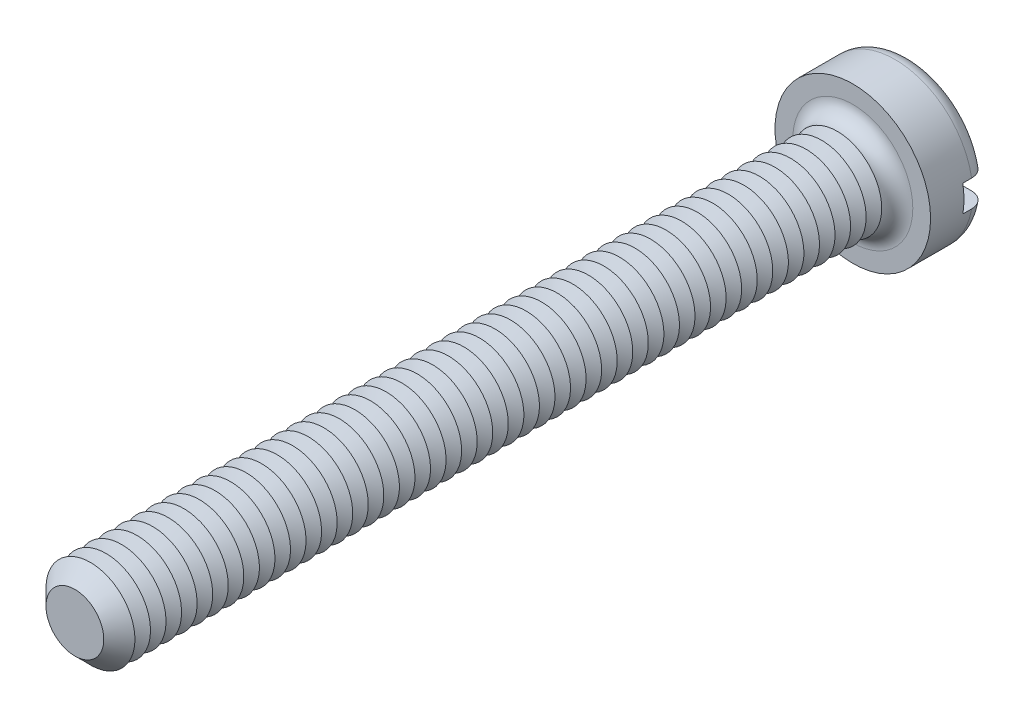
ISO-10303-21;
HEADER;
FILE_DESCRIPTION(('STEP AP214'),'2;1');
FILE_NAME('part.step','',(''),(''),'','','');
FILE_SCHEMA(('AUTOMOTIVE_DESIGN { 1 0 10303 214 1 1 1 1 }'));
ENDSEC;
DATA;
#1=APPLICATION_CONTEXT('core data for automotive mechanical design processes');
#2=APPLICATION_PROTOCOL_DEFINITION('international standard','automotive_design',2000,#1);
#3=PRODUCT_CONTEXT('',#1,'mechanical');
#4=PRODUCT('Part','Part','',(#3));
#5=PRODUCT_RELATED_PRODUCT_CATEGORY('part','',(#4));
#6=PRODUCT_DEFINITION_FORMATION('','',#4);
#7=PRODUCT_DEFINITION_CONTEXT('part definition',#1,'design');
#8=PRODUCT_DEFINITION('design','',#6,#7);
#9=PRODUCT_DEFINITION_SHAPE('','',#8);
#10=(LENGTH_UNIT() NAMED_UNIT(*) SI_UNIT(.MILLI.,.METRE.));
#11=(NAMED_UNIT(*) PLANE_ANGLE_UNIT() SI_UNIT($,.RADIAN.));
#12=(NAMED_UNIT(*) SI_UNIT($,.STERADIAN.) SOLID_ANGLE_UNIT());
#13=UNCERTAINTY_MEASURE_WITH_UNIT(LENGTH_MEASURE(1.E-05),#10,'distance_accuracy_value','');
#14=(GEOMETRIC_REPRESENTATION_CONTEXT(3) GLOBAL_UNCERTAINTY_ASSIGNED_CONTEXT((#13)) GLOBAL_UNIT_ASSIGNED_CONTEXT((#10,
#11,#12)) REPRESENTATION_CONTEXT('',''));
#15=CARTESIAN_POINT('',(0.,0.,0.));
#16=DIRECTION('',(0.,0.,1.));
#17=DIRECTION('',(1.,0.,0.));
#18=AXIS2_PLACEMENT_3D('',#15,#16,#17);
#19=CARTESIAN_POINT('',(0.,0.,-2.6));
#20=DIRECTION('',(0.,0.,1.));
#21=DIRECTION('',(1.,0.,0.));
#22=AXIS2_PLACEMENT_3D('',#19,#20,#21);
#23=PLANE('',#22);
#24=CARTESIAN_POINT('',(0.,0.,-2.6));
#25=DIRECTION('',(0.,0.,1.));
#26=DIRECTION('',(1.,0.,0.));
#27=AXIS2_PLACEMENT_3D('',#24,#25,#26);
#28=CIRCLE('',#27,2.8);
#29=CARTESIAN_POINT('',(-2.73495886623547,0.6,-2.6));
#30=VERTEX_POINT('',#29);
#31=CARTESIAN_POINT('',(2.73495886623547,0.6,-2.6));
#32=VERTEX_POINT('',#31);
#33=EDGE_CURVE('E116',#30,#32,#28,.F.);
#34=ORIENTED_EDGE('',*,*,#33,.T.);
#35=DIRECTION('',(1.,0.,0.));
#36=VECTOR('',#35,1.);
#37=CARTESIAN_POINT('',(-3.5,0.600000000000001,-2.6));
#38=LINE('',#37,#36);
#39=EDGE_CURVE('E111',#30,#32,#38,.T.);
#40=ORIENTED_EDGE('',*,*,#39,.F.);
#41=EDGE_LOOP('',(#34,#40));
#42=FACE_BOUND('',#41,.T.);
#43=ADVANCED_FACE('F39',(#42),#23,.F.);
#44=CARTESIAN_POINT('',(0.,0.,-1.9));
#45=DIRECTION('',(0.,0.,1.));
#46=DIRECTION('',(1.,0.,0.));
#47=AXIS2_PLACEMENT_3D('',#44,#45,#46);
#48=TOROIDAL_SURFACE('',#47,2.8,0.7);
#49=CARTESIAN_POINT('',(-3.24550494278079,0.600000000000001,-2.38938679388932));
#50=CARTESIAN_POINT('',(-3.21724139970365,0.600000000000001,-2.41780774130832));
#51=CARTESIAN_POINT('',(-3.18652103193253,0.600000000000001,-2.44383169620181));
#52=CARTESIAN_POINT('',(-3.12110229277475,0.600000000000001,-2.49034599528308));
#53=CARTESIAN_POINT('',(-3.08639834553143,0.6,-2.51082844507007));
#54=CARTESIAN_POINT('',(-3.01410013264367,0.6,-2.54568075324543));
#55=CARTESIAN_POINT('',(-2.97650963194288,0.6,-2.56005841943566));
#56=CARTESIAN_POINT('',(-2.89948250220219,0.6,-2.58239238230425));
#57=CARTESIAN_POINT('',(-2.86004633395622,0.6,-2.59035027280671));
#58=CARTESIAN_POINT('',(-2.77983715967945,0.6,-2.5997577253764));
#59=CARTESIAN_POINT('',(-2.73905311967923,0.6,-2.60111317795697));
#60=CARTESIAN_POINT('',(-2.65781876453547,0.6,-2.59706866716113));
#61=CARTESIAN_POINT('',(-2.61736849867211,0.6,-2.59166772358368));
#62=CARTESIAN_POINT('',(-2.53729983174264,0.6,-2.57414594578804));
#63=CARTESIAN_POINT('',(-2.49770360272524,0.6,-2.56192363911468));
#64=CARTESIAN_POINT('',(-2.421111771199,0.6,-2.5310238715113));
#65=CARTESIAN_POINT('',(-2.38411632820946,0.6,-2.51234601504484));
#66=CARTESIAN_POINT('',(-2.31371213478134,0.6,-2.46896762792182));
#67=CARTESIAN_POINT('',(-2.28031240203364,0.6,-2.44425244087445));
#68=CARTESIAN_POINT('',(-2.21823311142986,0.6,-2.38946667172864));
#69=CARTESIAN_POINT('',(-2.18955321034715,0.6,-2.35939647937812));
#70=CARTESIAN_POINT('',(-2.13836074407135,0.6,-2.29532787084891));
#71=CARTESIAN_POINT('',(-2.11574147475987,0.6,-2.26141482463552));
#72=CARTESIAN_POINT('',(-2.07677080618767,0.6,-2.19015935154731));
#73=CARTESIAN_POINT('',(-2.06041784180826,0.6,-2.15281778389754));
#74=CARTESIAN_POINT('',(-2.03508596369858,0.6,-2.07723332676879));
#75=CARTESIAN_POINT('',(-2.02585871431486,0.6,-2.03907365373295));
#76=CARTESIAN_POINT('',(-2.01416722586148,0.6,-1.96173417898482));
#77=CARTESIAN_POINT('',(-2.01170151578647,0.6,-1.92255460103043));
#78=CARTESIAN_POINT('',(-2.01359934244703,0.6,-1.84555709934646));
#79=CARTESIAN_POINT('',(-2.01775787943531,0.6,-1.80773393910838));
#80=CARTESIAN_POINT('',(-2.03236373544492,0.6,-1.73332511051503));
#81=CARTESIAN_POINT('',(-2.04281097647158,0.6,-1.69673942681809));
#82=CARTESIAN_POINT('',(-2.06962963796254,0.6,-1.62577336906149));
#83=CARTESIAN_POINT('',(-2.08600685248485,0.6,-1.59139519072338));
#84=CARTESIAN_POINT('',(-2.12413495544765,0.6,-1.52576356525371));
#85=CARTESIAN_POINT('',(-2.14588657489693,0.6,-1.49451054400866));
#86=CARTESIAN_POINT('',(-2.19483541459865,0.6,-1.43498643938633));
#87=CARTESIAN_POINT('',(-2.22217844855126,0.6,-1.40683532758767));
#88=CARTESIAN_POINT('',(-2.28105616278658,0.6,-1.35532544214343));
#89=CARTESIAN_POINT('',(-2.3125916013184,0.6,-1.33196753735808));
#90=CARTESIAN_POINT('',(-2.38018779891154,0.6,-1.28984356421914));
#91=CARTESIAN_POINT('',(-2.41637068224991,0.6,-1.27127330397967));
#92=CARTESIAN_POINT('',(-2.49129688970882,0.6,-1.24032971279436));
#93=CARTESIAN_POINT('',(-2.53004053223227,0.6,-1.22795715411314));
#94=CARTESIAN_POINT('',(-2.6098393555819,0.6,-1.2095515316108));
#95=CARTESIAN_POINT('',(-2.65092550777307,0.6,-1.20365237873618));
#96=CARTESIAN_POINT('',(-2.7335069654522,0.6,-1.1988380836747));
#97=CARTESIAN_POINT('',(-2.7750022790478,0.6,-1.19992308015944));
#98=CARTESIAN_POINT('',(-2.85718851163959,0.6,-1.20909046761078));
#99=CARTESIAN_POINT('',(-2.8978799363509,0.6,-1.21716830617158));
#100=CARTESIAN_POINT('',(-2.97729176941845,0.6,-1.24014327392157));
#101=CARTESIAN_POINT('',(-3.01601231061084,0.6,-1.25503994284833));
#102=CARTESIAN_POINT('',(-3.08976822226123,0.6,-1.29101066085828));
#103=CARTESIAN_POINT('',(-3.12484927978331,0.600000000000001,-1.31199098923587));
#104=CARTESIAN_POINT('',(-3.19090022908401,0.600000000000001,-1.35965144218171));
#105=CARTESIAN_POINT('',(-3.22187053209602,0.600000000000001,-1.38633099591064));
#106=CARTESIAN_POINT('',(-3.2781946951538,0.600000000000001,-1.44408564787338));
#107=CARTESIAN_POINT('',(-3.3036441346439,0.600000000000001,-1.47506754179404));
#108=CARTESIAN_POINT('',(-3.34887649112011,0.600000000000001,-1.54092398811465));
#109=CARTESIAN_POINT('',(-3.36865993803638,0.600000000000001,-1.57579817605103));
#110=CARTESIAN_POINT('',(-3.40166738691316,0.600000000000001,-1.64783067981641));
#111=CARTESIAN_POINT('',(-3.41499360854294,0.600000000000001,-1.68494217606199));
#112=CARTESIAN_POINT('',(-3.43515375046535,0.600000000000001,-1.76088675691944));
#113=CARTESIAN_POINT('',(-3.44198836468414,0.600000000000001,-1.79971965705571));
#114=CARTESIAN_POINT('',(-3.44891916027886,0.600000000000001,-1.87757893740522));
#115=CARTESIAN_POINT('',(-3.44908375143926,0.600000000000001,-1.91659924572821));
#116=CARTESIAN_POINT('',(-3.44284111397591,0.600000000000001,-1.99412088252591));
#117=CARTESIAN_POINT('',(-3.43643236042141,0.600000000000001,-2.03262208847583));
#118=CARTESIAN_POINT('',(-3.41725803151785,0.600000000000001,-2.10792315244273));
#119=CARTESIAN_POINT('',(-3.40450469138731,0.600000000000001,-2.14472613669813));
#120=CARTESIAN_POINT('',(-3.3730385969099,0.600000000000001,-2.21565060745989));
#121=CARTESIAN_POINT('',(-3.35433321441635,0.600000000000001,-2.24977534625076));
#122=CARTESIAN_POINT('',(-3.3201892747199,0.600000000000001,-2.30136364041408));
#123=CARTESIAN_POINT('',(-3.30647805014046,0.600000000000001,-2.31999402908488));
#124=CARTESIAN_POINT('',(-3.27728518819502,0.600000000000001,-2.35581090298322));
#125=CARTESIAN_POINT('',(-3.26180356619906,0.600000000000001,-2.37299740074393));
#126=CARTESIAN_POINT('',(-3.24550494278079,0.600000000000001,-2.38938679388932));
#127=B_SPLINE_CURVE_WITH_KNOTS('',3,(#49,#50,#51,#52,#53,#54,#55,#56,#57,#58,#59,#60,#61,#62,
#63,#64,#65,#66,#67,#68,#69,#70,#71,#72,#73,#74,#75,#76,#77,#78,#79,#80,#81,#82,#83,#84,#85,#86,
#87,#88,#89,#90,#91,#92,#93,#94,#95,#96,#97,#98,#99,#100,#101,#102,#103,#104,#105,#106,#107,
#108,#109,#110,#111,#112,#113,#114,#115,#116,#117,#118,#119,#120,#121,#122,#123,#124,#125,#126),
.UNSPECIFIED.,.T.,.F.,(4,2,2,2,2,2,2,2,2,2,2,2,2,2,2,2,2,2,2,2,2,2,2,2,2,2,2,2,2,2,2,2,2,2,2,2,
2,2,4),(0.,0.120160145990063,0.240490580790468,0.36066665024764,0.480812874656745,
0.602666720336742,0.724538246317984,0.848272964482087,0.972015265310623,1.09606100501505,
1.2200977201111,1.34178071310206,1.46343329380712,1.58062647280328,1.6977941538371,
1.81140573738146,1.92501591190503,2.03873739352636,2.15247435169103,2.26967910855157,
2.38690509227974,2.50835551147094,2.62982106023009,2.75375450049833,2.87769040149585,
3.00154567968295,3.12539259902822,3.24742469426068,3.36944457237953,3.48914477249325,
3.60883377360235,3.72656056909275,3.84427477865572,3.96078136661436,4.07731498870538,
4.19362474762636,4.3097910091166,4.37908387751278,4.44837614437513),.UNSPECIFIED.);
#128=CARTESIAN_POINT('',(-3.44818792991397,0.600000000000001,-1.8999999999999));
#129=VERTEX_POINT('',#128);
#130=EDGE_CURVE('E562',#129,#30,#127,.T.);
#131=ORIENTED_EDGE('',*,*,#130,.F.);
#132=CARTESIAN_POINT('',(0.,0.,-1.9));
#133=DIRECTION('',(0.,0.,1.));
#134=DIRECTION('',(1.,0.,0.));
#135=AXIS2_PLACEMENT_3D('',#132,#133,#134);
#136=CIRCLE('',#135,3.5);
#137=CARTESIAN_POINT('',(3.44818792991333,0.6,-1.9));
#138=VERTEX_POINT('',#137);
#139=EDGE_CURVE('E124',#138,#129,#136,.T.);
#140=ORIENTED_EDGE('',*,*,#139,.F.);
#141=CARTESIAN_POINT('',(2.1414268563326,0.6,-2.29762171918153));
#142=CARTESIAN_POINT('',(2.16505443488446,0.6,-2.33058245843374));
#143=CARTESIAN_POINT('',(2.19155609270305,0.6,-2.36152717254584));
#144=CARTESIAN_POINT('',(2.24942944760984,0.6,-2.41852964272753));
#145=CARTESIAN_POINT('',(2.28080921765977,0.6,-2.44457913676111));
#146=CARTESIAN_POINT('',(2.34741203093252,0.6,-2.49105381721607));
#147=CARTESIAN_POINT('',(2.38262862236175,0.6,-2.51148824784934));
#148=CARTESIAN_POINT('',(2.45593176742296,0.6,-2.54626881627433));
#149=CARTESIAN_POINT('',(2.49401741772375,0.6,-2.56061686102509));
#150=CARTESIAN_POINT('',(2.57272605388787,0.6,-2.58306429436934));
#151=CARTESIAN_POINT('',(2.6133821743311,0.6,-2.59104769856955));
#152=CARTESIAN_POINT('',(2.6954618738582,0.6,-2.60009608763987));
#153=CARTESIAN_POINT('',(2.73688552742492,0.6,-2.60116039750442));
#154=CARTESIAN_POINT('',(2.81941950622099,0.6,-2.5962925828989));
#155=CARTESIAN_POINT('',(2.86052888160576,0.6,-2.59034422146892));
#156=CARTESIAN_POINT('',(2.94113709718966,0.6,-2.57153687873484));
#157=CARTESIAN_POINT('',(2.98063603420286,0.6,-2.55867831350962));
#158=CARTESIAN_POINT('',(3.05633735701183,0.6,-2.52657771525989));
#159=CARTESIAN_POINT('',(3.09257627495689,0.6,-2.50742188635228));
#160=CARTESIAN_POINT('',(3.16123898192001,0.6,-2.46318606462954));
#161=CARTESIAN_POINT('',(3.19366316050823,0.6,-2.4381066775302));
#162=CARTESIAN_POINT('',(3.25312278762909,0.6,-2.38324481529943));
#163=CARTESIAN_POINT('',(3.28024842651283,0.6,-2.35356008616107));
#164=CARTESIAN_POINT('',(3.32902587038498,0.6,-2.28998971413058));
#165=CARTESIAN_POINT('',(3.35067820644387,0.6,-2.25610447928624));
#166=CARTESIAN_POINT('',(3.38751207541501,0.6,-2.18572286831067));
#167=CARTESIAN_POINT('',(3.40279804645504,0.6,-2.14928112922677));
#168=CARTESIAN_POINT('',(3.42695590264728,0.6,-2.07433042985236));
#169=CARTESIAN_POINT('',(3.43582824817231,0.6,-2.03582161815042));
#170=CARTESIAN_POINT('',(3.44682113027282,0.6,-1.95829536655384));
#171=CARTESIAN_POINT('',(3.44901648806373,0.6,-1.91928851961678));
#172=CARTESIAN_POINT('',(3.44680085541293,0.6,-1.84146366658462));
#173=CARTESIAN_POINT('',(3.44239008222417,0.6,-1.80264565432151));
#174=CARTESIAN_POINT('',(3.42712544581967,0.6,-1.72644634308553));
#175=CARTESIAN_POINT('',(3.41629508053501,0.6,-1.6890603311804));
#176=CARTESIAN_POINT('',(3.38853757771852,0.6,-1.61662604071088));
#177=CARTESIAN_POINT('',(3.37161039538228,0.6,-1.58157777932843));
#178=CARTESIAN_POINT('',(3.33207798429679,0.6,-1.51464178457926));
#179=CARTESIAN_POINT('',(3.30944854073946,0.6,-1.48276835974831));
#180=CARTESIAN_POINT('',(3.2592165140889,0.6,-1.42321861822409));
#181=CARTESIAN_POINT('',(3.23161370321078,0.6,-1.3955424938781));
#182=CARTESIAN_POINT('',(3.17188519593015,0.6,-1.34481834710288));
#183=CARTESIAN_POINT('',(3.13971065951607,0.6,-1.32182785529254));
#184=CARTESIAN_POINT('',(3.07201123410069,0.6,-1.28147003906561));
#185=CARTESIAN_POINT('',(3.03648608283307,0.6,-1.26410315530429));
#186=CARTESIAN_POINT('',(2.962449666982,0.6,-1.2351645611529));
#187=CARTESIAN_POINT('',(2.92389781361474,0.6,-1.22369671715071));
#188=CARTESIAN_POINT('',(2.84543273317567,0.6,-1.20726565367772));
#189=CARTESIAN_POINT('',(2.80551936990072,0.6,-1.20230308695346));
#190=CARTESIAN_POINT('',(2.72467191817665,0.6,-1.1989357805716));
#191=CARTESIAN_POINT('',(2.68373266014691,0.6,-1.20065484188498));
#192=CARTESIAN_POINT('',(2.60270222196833,0.6,-1.21084560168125));
#193=CARTESIAN_POINT('',(2.56261112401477,0.6,-1.21931795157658));
#194=CARTESIAN_POINT('',(2.48385954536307,0.6,-1.24292934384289));
#195=CARTESIAN_POINT('',(2.44522508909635,0.6,-1.25815531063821));
#196=CARTESIAN_POINT('',(2.37106165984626,0.6,-1.29488663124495));
#197=CARTESIAN_POINT('',(2.33553282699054,0.6,-1.31639226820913));
#198=CARTESIAN_POINT('',(2.2686996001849,0.6,-1.36507949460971));
#199=CARTESIAN_POINT('',(2.23738745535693,0.6,-1.39225042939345));
#200=CARTESIAN_POINT('',(2.17990424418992,0.6,-1.45157941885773));
#201=CARTESIAN_POINT('',(2.15373259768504,0.6,-1.48373691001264));
#202=CARTESIAN_POINT('',(2.10799355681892,0.6,-1.551327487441));
#203=CARTESIAN_POINT('',(2.08828258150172,0.6,-1.58666329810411));
#204=CARTESIAN_POINT('',(2.05534440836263,0.6,-1.66023600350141));
#205=CARTESIAN_POINT('',(2.042115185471,0.6,-1.6984719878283));
#206=CARTESIAN_POINT('',(2.02303126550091,0.6,-1.77519783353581));
#207=CARTESIAN_POINT('',(2.01691541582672,0.6,-1.8136228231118));
#208=CARTESIAN_POINT('',(2.01140375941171,0.6,-1.89096056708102));
#209=CARTESIAN_POINT('',(2.01200856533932,0.6,-1.92987336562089));
#210=CARTESIAN_POINT('',(2.01981617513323,0.6,-2.006065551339));
#211=CARTESIAN_POINT('',(2.02685835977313,0.6,-2.04336165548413));
#212=CARTESIAN_POINT('',(2.0470502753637,0.6,-2.1162250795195));
#213=CARTESIAN_POINT('',(2.06019252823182,0.6,-2.15179445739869));
#214=CARTESIAN_POINT('',(2.08525738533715,0.6,-2.20558874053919));
#215=CARTESIAN_POINT('',(2.09529161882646,0.6,-2.22471751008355));
#216=CARTESIAN_POINT('',(2.11708813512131,0.6,-2.26196179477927));
#217=CARTESIAN_POINT('',(2.12885034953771,0.6,-2.28007734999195));
#218=CARTESIAN_POINT('',(2.1414268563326,0.6,-2.29762171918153));
#219=B_SPLINE_CURVE_WITH_KNOTS('',3,(#141,#142,#143,#144,#145,#146,#147,#148,#149,#150,#151,
#152,#153,#154,#155,#156,#157,#158,#159,#160,#161,#162,#163,#164,#165,#166,#167,#168,#169,#170,
#171,#172,#173,#174,#175,#176,#177,#178,#179,#180,#181,#182,#183,#184,#185,#186,#187,#188,#189,
#190,#191,#192,#193,#194,#195,#196,#197,#198,#199,#200,#201,#202,#203,#204,#205,#206,#207,#208,
#209,#210,#211,#212,#213,#214,#215,#216,#217,#218),.UNSPECIFIED.,.T.,.F.,(4,2,2,2,2,2,2,2,2,2,2,
2,2,2,2,2,2,2,2,2,2,2,2,2,2,2,2,2,2,2,2,2,2,2,2,2,2,2,4),(0.,0.121582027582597,
0.243367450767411,0.364951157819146,0.486496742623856,0.610209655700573,0.733934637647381,
0.857946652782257,0.981951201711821,1.1043243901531,1.22668507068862,1.34673532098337,
1.46677391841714,1.58475736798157,1.70273234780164,1.81938035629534,1.93602452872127,
2.05224435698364,2.168465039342,2.28518782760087,2.40191596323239,2.52000081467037,
2.63809491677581,2.75820270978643,2.87832255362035,3.00067856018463,3.1230463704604,
3.24703703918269,3.37103329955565,3.49479843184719,3.6185495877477,3.73932715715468,
3.86006696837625,3.9762182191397,4.09238005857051,4.2057203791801,4.31892212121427,
4.38364046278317,4.44835624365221),.UNSPECIFIED.);
#220=EDGE_CURVE('E564',#32,#138,#219,.T.);
#221=ORIENTED_EDGE('',*,*,#220,.F.);
#222=ORIENTED_EDGE('',*,*,#33,.F.);
#223=EDGE_LOOP('',(#131,#140,#221,#222));
#224=FACE_BOUND('',#223,.T.);
#225=ADVANCED_FACE('F546',(#224),#48,.T.);
#226=CARTESIAN_POINT('',(0.,0.,-2.6));
#227=DIRECTION('',(0.,0.,1.));
#228=DIRECTION('',(1.,0.,0.));
#229=AXIS2_PLACEMENT_3D('',#226,#227,#228);
#230=CYLINDRICAL_SURFACE('',#229,3.5);
#231=DIRECTION('',(0.,0.,1.));
#232=VECTOR('',#231,1.);
#233=CARTESIAN_POINT('',(3.44818792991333,0.6,-2.6));
#234=LINE('',#233,#232);
#235=CARTESIAN_POINT('',(3.44818792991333,0.6,-1.5));
#236=VERTEX_POINT('',#235);
#237=EDGE_CURVE('E578',#138,#236,#234,.T.);
#238=ORIENTED_EDGE('',*,*,#237,.F.);
#239=ORIENTED_EDGE('',*,*,#139,.T.);
#240=DIRECTION('',(0.,0.,1.));
#241=VECTOR('',#240,1.);
#242=CARTESIAN_POINT('',(-3.44818792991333,0.600000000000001,-2.6));
#243=LINE('',#242,#241);
#244=CARTESIAN_POINT('',(-3.44818792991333,0.600000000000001,-1.5));
#245=VERTEX_POINT('',#244);
#246=EDGE_CURVE('E63',#245,#129,#243,.F.);
#247=ORIENTED_EDGE('',*,*,#246,.F.);
#248=CARTESIAN_POINT('',(0.,0.,-1.5));
#249=DIRECTION('',(0.,0.,-1.));
#250=DIRECTION('',(-1.,0.,0.));
#251=AXIS2_PLACEMENT_3D('',#248,#249,#250);
#252=CIRCLE('',#251,3.5);
#253=CARTESIAN_POINT('',(-3.44818792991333,-0.599999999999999,-1.5));
#254=VERTEX_POINT('',#253);
#255=EDGE_CURVE('E43',#245,#254,#252,.F.);
#256=ORIENTED_EDGE('',*,*,#255,.T.);
#257=DIRECTION('',(0.,0.,1.));
#258=VECTOR('',#257,1.);
#259=CARTESIAN_POINT('',(-3.44818792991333,-0.599999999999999,-2.6));
#260=LINE('',#259,#258);
#261=CARTESIAN_POINT('',(-3.44818792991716,-0.599999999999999,-1.90000000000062));
#262=VERTEX_POINT('',#261);
#263=EDGE_CURVE('E575',#262,#254,#260,.T.);
#264=ORIENTED_EDGE('',*,*,#263,.F.);
#265=CARTESIAN_POINT('',(3.44818792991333,-0.6,-1.9));
#266=VERTEX_POINT('',#265);
#267=EDGE_CURVE('E126',#262,#266,#136,.T.);
#268=ORIENTED_EDGE('',*,*,#267,.T.);
#269=DIRECTION('',(0.,0.,1.));
#270=VECTOR('',#269,1.);
#271=CARTESIAN_POINT('',(3.44818792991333,-0.6,-2.6));
#272=LINE('',#271,#270);
#273=CARTESIAN_POINT('',(3.44818792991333,-0.6,-1.5));
#274=VERTEX_POINT('',#273);
#275=EDGE_CURVE('E55',#274,#266,#272,.F.);
#276=ORIENTED_EDGE('',*,*,#275,.F.);
#277=EDGE_CURVE('E11',#274,#236,#252,.F.);
#278=ORIENTED_EDGE('',*,*,#277,.T.);
#279=EDGE_LOOP('',(#238,#239,#247,#256,#264,#268,#276,#278));
#280=FACE_BOUND('',#279,.T.);
#281=CARTESIAN_POINT('',(0.,0.,0.));
#282=DIRECTION('',(0.,0.,1.));
#283=DIRECTION('',(1.,0.,0.));
#284=AXIS2_PLACEMENT_3D('',#281,#282,#283);
#285=CIRCLE('',#284,3.5);
#286=CARTESIAN_POINT('',(3.5,0.,0.));
#287=VERTEX_POINT('',#286);
#288=EDGE_CURVE('E581',#287,#287,#285,.T.);
#289=ORIENTED_EDGE('',*,*,#288,.F.);
#290=EDGE_LOOP('',(#289));
#291=FACE_BOUND('',#290,.T.);
#292=ADVANCED_FACE('F542',(#280,#291),#230,.T.);
#293=CARTESIAN_POINT('',(2.73495886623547,-0.6,-2.6));
#294=VERTEX_POINT('',#293);
#295=CARTESIAN_POINT('',(-2.73495886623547,-0.6,-2.6));
#296=VERTEX_POINT('',#295);
#297=EDGE_CURVE('E109',#294,#296,#28,.F.);
#298=ORIENTED_EDGE('',*,*,#297,.T.);
#299=DIRECTION('',(-1.,0.,0.));
#300=VECTOR('',#299,1.);
#301=CARTESIAN_POINT('',(-3.5,-0.599999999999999,-2.6));
#302=LINE('',#301,#300);
#303=EDGE_CURVE('E96',#294,#296,#302,.T.);
#304=ORIENTED_EDGE('',*,*,#303,.F.);
#305=EDGE_LOOP('',(#298,#304));
#306=FACE_BOUND('',#305,.T.);
#307=ADVANCED_FACE('F108',(#306),#23,.F.);
#308=CARTESIAN_POINT('',(0.,0.,0.));
#309=DIRECTION('',(0.,0.,1.));
#310=DIRECTION('',(1.,0.,0.));
#311=AXIS2_PLACEMENT_3D('',#308,#309,#310);
#312=PLANE('',#311);
#313=CARTESIAN_POINT('',(0.,0.,0.));
#314=DIRECTION('',(0.,0.,1.));
#315=DIRECTION('',(1.,0.,0.));
#316=AXIS2_PLACEMENT_3D('',#313,#314,#315);
#317=CIRCLE('',#316,2.7);
#318=CARTESIAN_POINT('',(2.7,0.,0.));
#319=VERTEX_POINT('',#318);
#320=EDGE_CURVE('E115',#319,#319,#317,.F.);
#321=ORIENTED_EDGE('',*,*,#320,.T.);
#322=EDGE_LOOP('',(#321));
#323=FACE_BOUND('',#322,.T.);
#324=ORIENTED_EDGE('',*,*,#288,.T.);
#325=EDGE_LOOP('',(#324));
#326=FACE_BOUND('',#325,.T.);
#327=ADVANCED_FACE('F541',(#323,#326),#312,.T.);
#328=CARTESIAN_POINT('',(-3.24550494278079,-0.599999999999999,-2.38938679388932));
#329=CARTESIAN_POINT('',(-3.27309693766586,-0.599999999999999,-2.36163611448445));
#330=CARTESIAN_POINT('',(-3.29838741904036,-0.599999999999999,-2.3315608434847));
#331=CARTESIAN_POINT('',(-3.34359429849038,-0.599999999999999,-2.26757659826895));
#332=CARTESIAN_POINT('',(-3.36350518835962,-0.599999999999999,-2.23366374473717));
#333=CARTESIAN_POINT('',(-3.39733065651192,-0.599999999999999,-2.16296274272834));
#334=CARTESIAN_POINT('',(-3.4112451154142,-0.599999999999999,-2.12617453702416));
#335=CARTESIAN_POINT('',(-3.43264462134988,-0.599999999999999,-2.05078178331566));
#336=CARTESIAN_POINT('',(-3.44013114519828,-0.599999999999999,-2.01217765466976));
#337=CARTESIAN_POINT('',(-3.44841975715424,-0.599999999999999,-1.9345391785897));
#338=CARTESIAN_POINT('',(-3.44926944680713,-0.599999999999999,-1.89550990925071));
#339=CARTESIAN_POINT('',(-3.44438358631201,-0.599999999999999,-1.81786552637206));
#340=CARTESIAN_POINT('',(-3.43864801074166,-0.599999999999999,-1.77925041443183));
#341=CARTESIAN_POINT('',(-3.42079221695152,-0.599999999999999,-1.70364264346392));
#342=CARTESIAN_POINT('',(-3.40869011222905,-0.599999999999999,-1.66664570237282));
#343=CARTESIAN_POINT('',(-3.37847692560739,-0.599999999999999,-1.59519424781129));
#344=CARTESIAN_POINT('',(-3.3603657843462,-0.599999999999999,-1.56073975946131));
#345=CARTESIAN_POINT('',(-3.31856549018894,-0.599999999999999,-1.4951524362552));
#346=CARTESIAN_POINT('',(-3.29484830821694,-0.599999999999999,-1.46403747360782));
#347=CARTESIAN_POINT('',(-3.24258489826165,-0.599999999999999,-1.40617131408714));
#348=CARTESIAN_POINT('',(-3.21403843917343,-0.599999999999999,-1.37942032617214));
#349=CARTESIAN_POINT('',(-3.15256084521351,-0.599999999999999,-1.33067963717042));
#350=CARTESIAN_POINT('',(-3.11958015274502,-0.599999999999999,-1.30875246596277));
#351=CARTESIAN_POINT('',(-3.0504559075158,-0.599999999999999,-1.27063718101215));
#352=CARTESIAN_POINT('',(-3.01431209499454,-0.6,-1.25444953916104));
#353=CARTESIAN_POINT('',(-2.93921710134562,-0.6,-1.22796796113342));
#354=CARTESIAN_POINT('',(-2.90022796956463,-0.6,-1.217781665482));
#355=CARTESIAN_POINT('',(-2.82110512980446,-0.6,-1.20396915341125));
#356=CARTESIAN_POINT('',(-2.7809713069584,-0.6,-1.2003435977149));
#357=CARTESIAN_POINT('',(-2.69990924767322,-0.6,-1.19969717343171));
#358=CARTESIAN_POINT('',(-2.65898001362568,-0.6,-1.20279937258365));
#359=CARTESIAN_POINT('',(-2.57819986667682,-0.6,-1.21574287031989));
#360=CARTESIAN_POINT('',(-2.53834905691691,-0.6,-1.22558481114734));
#361=CARTESIAN_POINT('',(-2.46035232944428,-0.6,-1.25189361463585));
#362=CARTESIAN_POINT('',(-2.42223314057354,-0.6,-1.2684398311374));
#363=CARTESIAN_POINT('',(-2.34932316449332,-0.6,-1.30771928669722));
#364=CARTESIAN_POINT('',(-2.31453248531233,-0.6,-1.33045272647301));
#365=CARTESIAN_POINT('',(-2.24945577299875,-0.6,-1.38141543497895));
#366=CARTESIAN_POINT('',(-2.21915255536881,-0.6,-1.40962272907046));
#367=CARTESIAN_POINT('',(-2.16386461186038,-0.6,-1.47084552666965));
#368=CARTESIAN_POINT('',(-2.13887916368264,-0.6,-1.50386037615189));
#369=CARTESIAN_POINT('',(-2.09568071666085,-0.6,-1.57285917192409));
#370=CARTESIAN_POINT('',(-2.07730739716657,-0.6,-1.60874263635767));
#371=CARTESIAN_POINT('',(-2.04712019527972,-0.6,-1.68316975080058));
#372=CARTESIAN_POINT('',(-2.03530452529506,-0.6,-1.72171267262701));
#373=CARTESIAN_POINT('',(-2.01901751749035,-0.6,-1.79878952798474));
#374=CARTESIAN_POINT('',(-2.01428434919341,-0.6,-1.8372682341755));
#375=CARTESIAN_POINT('',(-2.01150652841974,-0.6,-1.91446369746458));
#376=CARTESIAN_POINT('',(-2.01346084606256,-0.6,-1.95318041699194));
#377=CARTESIAN_POINT('',(-2.02386268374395,-0.6,-2.0288619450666));
#378=CARTESIAN_POINT('',(-2.03216724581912,-0.6,-2.06584654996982));
#379=CARTESIAN_POINT('',(-2.05479337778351,-0.6,-2.13792373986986));
#380=CARTESIAN_POINT('',(-2.06911522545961,-0.6,-2.1730162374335));
#381=CARTESIAN_POINT('',(-2.10349906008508,-0.6,-2.24081034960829));
#382=CARTESIAN_POINT('',(-2.12363007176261,-0.6,-2.27347689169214));
#383=CARTESIAN_POINT('',(-2.16891308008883,-0.6,-2.33511902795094));
#384=CARTESIAN_POINT('',(-2.19406590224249,-0.6,-2.36409401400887));
#385=CARTESIAN_POINT('',(-2.24962389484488,-0.6,-2.41861972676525));
#386=CARTESIAN_POINT('',(-2.28018314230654,-0.6,-2.44401345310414));
#387=CARTESIAN_POINT('',(-2.34501720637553,-0.6,-2.48950558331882));
#388=CARTESIAN_POINT('',(-2.37929266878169,-0.6,-2.50960306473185));
#389=CARTESIAN_POINT('',(-2.45179417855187,-0.6,-2.54458276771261));
#390=CARTESIAN_POINT('',(-2.49011248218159,-0.6,-2.55927401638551));
#391=CARTESIAN_POINT('',(-2.56865227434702,-0.6,-2.58211133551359));
#392=CARTESIAN_POINT('',(-2.60887386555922,-0.6,-2.59025705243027));
#393=CARTESIAN_POINT('',(-2.69064746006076,-0.6,-2.59982905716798));
#394=CARTESIAN_POINT('',(-2.73220999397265,-0.6,-2.60116580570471));
#395=CARTESIAN_POINT('',(-2.81497658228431,-0.6,-2.59679700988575));
#396=CARTESIAN_POINT('',(-2.85618055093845,-0.6,-2.59108982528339));
#397=CARTESIAN_POINT('',(-2.93677683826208,-0.6,-2.57279487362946));
#398=CARTESIAN_POINT('',(-2.97617834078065,-0.6,-2.56024753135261));
#399=CARTESIAN_POINT('',(-3.05222242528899,-0.6,-2.52860709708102));
#400=CARTESIAN_POINT('',(-3.08886850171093,-0.599999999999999,-2.50952247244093));
#401=CARTESIAN_POINT('',(-3.14562501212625,-0.599999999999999,-2.47340693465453));
#402=CARTESIAN_POINT('',(-3.16689358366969,-0.599999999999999,-2.45816337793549));
#403=CARTESIAN_POINT('',(-3.20761866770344,-0.599999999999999,-2.42542115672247));
#404=CARTESIAN_POINT('',(-3.22707520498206,-0.599999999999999,-2.40792252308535));
#405=CARTESIAN_POINT('',(-3.24550494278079,-0.599999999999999,-2.38938679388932));
#406=B_SPLINE_CURVE_WITH_KNOTS('',3,(#328,#329,#330,#331,#332,#333,#334,#335,#336,#337,#338,
#339,#340,#341,#342,#343,#344,#345,#346,#347,#348,#349,#350,#351,#352,#353,#354,#355,#356,#357,
#358,#359,#360,#361,#362,#363,#364,#365,#366,#367,#368,#369,#370,#371,#372,#373,#374,#375,#376,
#377,#378,#379,#380,#381,#382,#383,#384,#385,#386,#387,#388,#389,#390,#391,#392,#393,#394,#395,
#396,#397,#398,#399,#400,#401,#402,#403,#404,#405),.UNSPECIFIED.,.T.,.F.,(4,2,2,2,2,2,2,2,2,2,2,
2,2,2,2,2,2,2,2,2,2,2,2,2,2,2,2,2,2,2,2,2,2,2,2,2,2,2,4),(0.,0.117306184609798,
0.234732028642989,0.352160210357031,0.469561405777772,0.586119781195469,0.702678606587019,
0.818907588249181,0.935137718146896,1.05196174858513,1.1687913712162,1.2870562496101,
1.40533084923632,1.52566688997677,1.64601504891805,1.76858322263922,1.89116307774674,
2.01523830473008,2.13931755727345,2.26290863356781,2.38648291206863,2.50681878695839,
2.62712184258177,2.74285697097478,2.85857427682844,2.97176054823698,3.08495204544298,
3.19954814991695,3.31416310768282,3.43282436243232,3.55150627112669,3.67404987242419,
3.79660009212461,3.92075778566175,4.04494439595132,4.16840490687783,4.29170610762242,
4.3700604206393,4.44841366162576),.UNSPECIFIED.);
#407=EDGE_CURVE('E103',#296,#262,#406,.T.);
#408=ORIENTED_EDGE('',*,*,#407,.F.);
#409=ORIENTED_EDGE('',*,*,#297,.F.);
#410=CARTESIAN_POINT('',(2.1414268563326,-0.6,-2.29762171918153));
#411=CARTESIAN_POINT('',(2.11900044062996,-0.6,-2.26633119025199));
#412=CARTESIAN_POINT('',(2.09913154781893,-0.6,-2.23318080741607));
#413=CARTESIAN_POINT('',(2.06517900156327,-0.6,-2.16401111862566));
#414=CARTESIAN_POINT('',(2.05109968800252,-0.6,-2.12798968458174));
#415=CARTESIAN_POINT('',(2.02923593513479,-0.6,-2.05404277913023));
#416=CARTESIAN_POINT('',(2.02145692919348,-0.6,-2.01611569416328));
#417=CARTESIAN_POINT('',(2.01251710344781,-0.6,-1.93949649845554));
#418=CARTESIAN_POINT('',(2.01135461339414,-0.6,-1.90080458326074));
#419=CARTESIAN_POINT('',(2.01564803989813,-0.6,-1.82450508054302));
#420=CARTESIAN_POINT('',(2.02098305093,-0.6,-1.78689061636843));
#421=CARTESIAN_POINT('',(2.03786826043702,-0.6,-1.71308589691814));
#422=CARTESIAN_POINT('',(2.04941870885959,-0.6,-1.67689569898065));
#423=CARTESIAN_POINT('',(2.07838664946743,-0.6,-1.60676639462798));
#424=CARTESIAN_POINT('',(2.09582944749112,-0.6,-1.57283776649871));
#425=CARTESIAN_POINT('',(2.1359925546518,-0.6,-1.50826612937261));
#426=CARTESIAN_POINT('',(2.15871360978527,-0.6,-1.47762358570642));
#427=CARTESIAN_POINT('',(2.20955413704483,-0.6,-1.41943384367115));
#428=CARTESIAN_POINT('',(2.23782364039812,-0.6,-1.39201777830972));
#429=CARTESIAN_POINT('',(2.29842612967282,-0.6,-1.34212199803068));
#430=CARTESIAN_POINT('',(2.33075984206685,-0.6,-1.31964316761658));
#431=CARTESIAN_POINT('',(2.399806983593,-0.6,-1.27945238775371));
#432=CARTESIAN_POINT('',(2.43663466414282,-0.6,-1.26193653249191));
#433=CARTESIAN_POINT('',(2.51267241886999,-0.6,-1.23320660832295));
#434=CARTESIAN_POINT('',(2.55188277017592,-0.6,-1.22199327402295));
#435=CARTESIAN_POINT('',(2.63235000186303,-0.6,-1.20602688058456));
#436=CARTESIAN_POINT('',(2.673631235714,-0.6,-1.20139617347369));
#437=CARTESIAN_POINT('',(2.7563863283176,-0.6,-1.19914622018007));
#438=CARTESIAN_POINT('',(2.79786018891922,-0.6,-1.20152704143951));
#439=CARTESIAN_POINT('',(2.87971192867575,-0.6,-1.21326884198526));
#440=CARTESIAN_POINT('',(2.92009214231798,-0.6,-1.22261349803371));
#441=CARTESIAN_POINT('',(2.99866777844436,-0.6,-1.24805614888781));
#442=CARTESIAN_POINT('',(3.03686335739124,-0.6,-1.26415365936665));
#443=CARTESIAN_POINT('',(3.10934738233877,-0.6,-1.3023912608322));
#444=CARTESIAN_POINT('',(3.14368704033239,-0.6,-1.32443423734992));
#445=CARTESIAN_POINT('',(3.20808395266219,-0.6,-1.37407725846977));
#446=CARTESIAN_POINT('',(3.23814164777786,-0.6,-1.40167673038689));
#447=CARTESIAN_POINT('',(3.29251534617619,-0.6,-1.46108303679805));
#448=CARTESIAN_POINT('',(3.3169296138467,-0.6,-1.49279994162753));
#449=CARTESIAN_POINT('',(3.35998418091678,-0.6,-1.55993706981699));
#450=CARTESIAN_POINT('',(3.37862502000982,-0.6,-1.59535694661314));
#451=CARTESIAN_POINT('',(3.40930212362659,-0.6,-1.668283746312));
#452=CARTESIAN_POINT('',(3.42143897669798,-0.6,-1.70574837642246));
#453=CARTESIAN_POINT('',(3.43918305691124,-0.6,-1.78219297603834));
#454=CARTESIAN_POINT('',(3.44479069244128,-0.6,-1.82117285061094));
#455=CARTESIAN_POINT('',(3.44928173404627,-0.6,-1.89914596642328));
#456=CARTESIAN_POINT('',(3.44822835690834,-0.6,-1.93813558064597));
#457=CARTESIAN_POINT('',(3.43957811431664,-0.6,-2.0153811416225));
#458=CARTESIAN_POINT('',(3.43198139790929,-0.6,-2.05363710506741));
#459=CARTESIAN_POINT('',(3.41049386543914,-0.6,-2.12826741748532));
#460=CARTESIAN_POINT('',(3.39661362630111,-0.6,-2.16464481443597));
#461=CARTESIAN_POINT('',(3.36297924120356,-0.6,-2.23457274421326));
#462=CARTESIAN_POINT('',(3.34322499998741,-0.6,-2.26812323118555));
#463=CARTESIAN_POINT('',(3.29828706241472,-0.6,-2.33167864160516));
#464=CARTESIAN_POINT('',(3.27307040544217,-0.6,-2.36166024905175));
#465=CARTESIAN_POINT('',(3.21802069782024,-0.6,-2.41703165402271));
#466=CARTESIAN_POINT('',(3.18818738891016,-0.6,-2.44242119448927));
#467=CARTESIAN_POINT('',(3.12433871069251,-0.6,-2.48825551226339));
#468=CARTESIAN_POINT('',(3.09027338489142,-0.6,-2.50863067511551));
#469=CARTESIAN_POINT('',(3.01925175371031,-0.6,-2.54348754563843));
#470=CARTESIAN_POINT('',(2.982295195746,-0.6,-2.55796873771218));
#471=CARTESIAN_POINT('',(2.90583499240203,-0.6,-2.58090526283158));
#472=CARTESIAN_POINT('',(2.86629758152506,-0.6,-2.58924801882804));
#473=CARTESIAN_POINT('',(2.78639041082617,-0.6,-2.59930573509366));
#474=CARTESIAN_POINT('',(2.7460205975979,-0.6,-2.60102026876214));
#475=CARTESIAN_POINT('',(2.66482039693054,-0.6,-2.59779078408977));
#476=CARTESIAN_POINT('',(2.62399477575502,-0.6,-2.59272651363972));
#477=CARTESIAN_POINT('',(2.54373809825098,-0.6,-2.57588976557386));
#478=CARTESIAN_POINT('',(2.50430750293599,-0.6,-2.56411509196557));
#479=CARTESIAN_POINT('',(2.42753167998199,-0.6,-2.53401488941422));
#480=CARTESIAN_POINT('',(2.39021407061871,-0.6,-2.51561892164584));
#481=CARTESIAN_POINT('',(2.31925431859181,-0.6,-2.4727929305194));
#482=CARTESIAN_POINT('',(2.28560806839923,-0.6,-2.44836975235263));
#483=CARTESIAN_POINT('',(2.23316677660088,-0.6,-2.40295212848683));
#484=CARTESIAN_POINT('',(2.21309339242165,-0.6,-2.38341311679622));
#485=CARTESIAN_POINT('',(2.17537212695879,-0.6,-2.34211733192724));
#486=CARTESIAN_POINT('',(2.1577241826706,-0.6,-2.32036061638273));
#487=CARTESIAN_POINT('',(2.1414268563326,-0.6,-2.29762171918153));
#488=B_SPLINE_CURVE_WITH_KNOTS('',3,(#410,#411,#412,#413,#414,#415,#416,#417,#418,#419,#420,
#421,#422,#423,#424,#425,#426,#427,#428,#429,#430,#431,#432,#433,#434,#435,#436,#437,#438,#439,
#440,#441,#442,#443,#444,#445,#446,#447,#448,#449,#450,#451,#452,#453,#454,#455,#456,#457,#458,
#459,#460,#461,#462,#463,#464,#465,#466,#467,#468,#469,#470,#471,#472,#473,#474,#475,#476,#477,
#478,#479,#480,#481,#482,#483,#484,#485,#486,#487),.UNSPECIFIED.,.T.,.F.,(4,2,2,2,2,2,2,2,2,2,2,
2,2,2,2,2,2,2,2,2,2,2,2,2,2,2,2,2,2,2,2,2,2,2,2,2,2,2,4),(0.,0.115394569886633,
0.230875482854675,0.346455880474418,0.462007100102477,0.575440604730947,0.688878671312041,
0.802810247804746,0.91675793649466,1.03436780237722,1.15199872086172,1.27377854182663,
1.39557255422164,1.51960202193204,1.64363268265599,1.76737352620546,1.89110549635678,
2.01292743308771,2.13473682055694,2.25423121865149,2.37371444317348,2.49129215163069,
2.60886250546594,2.72531873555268,2.8417723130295,2.95803059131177,3.07429075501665,
3.19127301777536,3.30826182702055,3.42679321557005,3.54533497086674,3.66599996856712,
3.78667273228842,3.90951478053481,4.03239705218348,4.15662720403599,4.28071691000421,
4.36457658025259,4.44843407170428),.UNSPECIFIED.);
#489=EDGE_CURVE('E92',#266,#294,#488,.T.);
#490=ORIENTED_EDGE('',*,*,#489,.F.);
#491=ORIENTED_EDGE('',*,*,#267,.F.);
#492=EDGE_LOOP('',(#408,#409,#490,#491));
#493=FACE_BOUND('',#492,.T.);
#494=ADVANCED_FACE('F113',(#493),#48,.T.);
#495=CARTESIAN_POINT('',(0.,0.,0.699999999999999));
#496=DIRECTION('',(0.,0.,1.));
#497=DIRECTION('',(1.,0.,0.));
#498=AXIS2_PLACEMENT_3D('',#495,#496,#497);
#499=TOROIDAL_SURFACE('',#498,2.7,0.7);
#500=ORIENTED_EDGE('',*,*,#320,.F.);
#501=EDGE_LOOP('',(#500));
#502=FACE_BOUND('',#501,.T.);
#503=CARTESIAN_POINT('',(0.,0.,0.699999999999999));
#504=DIRECTION('',(0.,0.,-1.));
#505=DIRECTION('',(-1.,0.,0.));
#506=AXIS2_PLACEMENT_3D('',#503,#504,#505);
#507=CIRCLE('',#506,2.);
#508=CARTESIAN_POINT('',(-2.,0.,0.699999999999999));
#509=VERTEX_POINT('',#508);
#510=EDGE_CURVE('E587',#509,#509,#507,.T.);
#511=ORIENTED_EDGE('',*,*,#510,.T.);
#512=EDGE_LOOP('',(#511));
#513=FACE_BOUND('',#512,.T.);
#514=ADVANCED_FACE('F534',(#502,#513),#499,.F.);
#515=CARTESIAN_POINT('',(0.,0.,1.05));
#516=DIRECTION('',(0.,0.,-1.));
#517=DIRECTION('',(-1.,0.,0.));
#518=AXIS2_PLACEMENT_3D('',#515,#516,#517);
#519=CONICAL_SURFACE('',#518,1.39378221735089,1.0471975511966);
#520=ORIENTED_EDGE('',*,*,#510,.F.);
#521=EDGE_LOOP('',(#520));
#522=FACE_BOUND('',#521,.T.);
#523=CARTESIAN_POINT('',(0.,0.,1.05));
#524=DIRECTION('',(0.,0.,-1.));
#525=DIRECTION('',(-1.,0.,0.));
#526=AXIS2_PLACEMENT_3D('',#523,#524,#525);
#527=CIRCLE('',#526,1.39378221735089);
#528=CARTESIAN_POINT('',(-1.39378221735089,0.,1.05));
#529=VERTEX_POINT('',#528);
#530=EDGE_CURVE('E593',#529,#529,#527,.T.);
#531=ORIENTED_EDGE('',*,*,#530,.T.);
#532=EDGE_LOOP('',(#531));
#533=FACE_BOUND('',#532,.T.);
#534=ADVANCED_FACE('F530',(#522,#533),#519,.T.);
#535=CARTESIAN_POINT('',(0.,0.,1.4));
#536=DIRECTION('',(0.,0.,1.));
#537=DIRECTION('',(1.,0.,0.));
#538=AXIS2_PLACEMENT_3D('',#535,#536,#537);
#539=CONICAL_SURFACE('',#538,2.,1.0471975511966);
#540=ORIENTED_EDGE('',*,*,#530,.F.);
#541=EDGE_LOOP('',(#540));
#542=FACE_BOUND('',#541,.T.);
#543=CARTESIAN_POINT('',(0.,0.,1.4));
#544=DIRECTION('',(0.,0.,-1.));
#545=DIRECTION('',(-1.,0.,0.));
#546=AXIS2_PLACEMENT_3D('',#543,#544,#545);
#547=CIRCLE('',#546,2.);
#548=CARTESIAN_POINT('',(-2.,0.,1.4));
#549=VERTEX_POINT('',#548);
#550=EDGE_CURVE('E599',#549,#549,#547,.T.);
#551=ORIENTED_EDGE('',*,*,#550,.T.);
#552=EDGE_LOOP('',(#551));
#553=FACE_BOUND('',#552,.T.);
#554=ADVANCED_FACE('F526',(#542,#553),#539,.T.);
#555=CARTESIAN_POINT('',(0.,0.,1.75));
#556=DIRECTION('',(0.,0.,-1.));
#557=DIRECTION('',(-1.,0.,0.));
#558=AXIS2_PLACEMENT_3D('',#555,#556,#557);
#559=CONICAL_SURFACE('',#558,1.39378221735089,1.0471975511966);
#560=ORIENTED_EDGE('',*,*,#550,.F.);
#561=EDGE_LOOP('',(#560));
#562=FACE_BOUND('',#561,.T.);
#563=CARTESIAN_POINT('',(0.,0.,1.75));
#564=DIRECTION('',(0.,0.,-1.));
#565=DIRECTION('',(-1.,0.,0.));
#566=AXIS2_PLACEMENT_3D('',#563,#564,#565);
#567=CIRCLE('',#566,1.39378221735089);
#568=CARTESIAN_POINT('',(-1.39378221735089,0.,1.75));
#569=VERTEX_POINT('',#568);
#570=EDGE_CURVE('E603',#569,#569,#567,.T.);
#571=ORIENTED_EDGE('',*,*,#570,.T.);
#572=EDGE_LOOP('',(#571));
#573=FACE_BOUND('',#572,.T.);
#574=ADVANCED_FACE('F522',(#562,#573),#559,.T.);
#575=CARTESIAN_POINT('',(0.,0.,2.1));
#576=DIRECTION('',(0.,0.,1.));
#577=DIRECTION('',(1.,0.,0.));
#578=AXIS2_PLACEMENT_3D('',#575,#576,#577);
#579=CONICAL_SURFACE('',#578,2.,1.0471975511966);
#580=ORIENTED_EDGE('',*,*,#570,.F.);
#581=EDGE_LOOP('',(#580));
#582=FACE_BOUND('',#581,.T.);
#583=CARTESIAN_POINT('',(0.,0.,2.1));
#584=DIRECTION('',(0.,0.,-1.));
#585=DIRECTION('',(-1.,0.,0.));
#586=AXIS2_PLACEMENT_3D('',#583,#584,#585);
#587=CIRCLE('',#586,2.);
#588=CARTESIAN_POINT('',(-2.,0.,2.1));
#589=VERTEX_POINT('',#588);
#590=EDGE_CURVE('E607',#589,#589,#587,.T.);
#591=ORIENTED_EDGE('',*,*,#590,.T.);
#592=EDGE_LOOP('',(#591));
#593=FACE_BOUND('',#592,.T.);
#594=ADVANCED_FACE('F518',(#582,#593),#579,.T.);
#595=CARTESIAN_POINT('',(0.,0.,2.45));
#596=DIRECTION('',(0.,0.,-1.));
#597=DIRECTION('',(-1.,0.,0.));
#598=AXIS2_PLACEMENT_3D('',#595,#596,#597);
#599=CONICAL_SURFACE('',#598,1.39378221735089,1.0471975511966);
#600=ORIENTED_EDGE('',*,*,#590,.F.);
#601=EDGE_LOOP('',(#600));
#602=FACE_BOUND('',#601,.T.);
#603=CARTESIAN_POINT('',(0.,0.,2.45));
#604=DIRECTION('',(0.,0.,-1.));
#605=DIRECTION('',(-1.,0.,0.));
#606=AXIS2_PLACEMENT_3D('',#603,#604,#605);
#607=CIRCLE('',#606,1.39378221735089);
#608=CARTESIAN_POINT('',(-1.39378221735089,0.,2.45));
#609=VERTEX_POINT('',#608);
#610=EDGE_CURVE('E611',#609,#609,#607,.T.);
#611=ORIENTED_EDGE('',*,*,#610,.T.);
#612=EDGE_LOOP('',(#611));
#613=FACE_BOUND('',#612,.T.);
#614=ADVANCED_FACE('F514',(#602,#613),#599,.T.);
#615=CARTESIAN_POINT('',(0.,0.,2.8));
#616=DIRECTION('',(0.,0.,1.));
#617=DIRECTION('',(1.,0.,0.));
#618=AXIS2_PLACEMENT_3D('',#615,#616,#617);
#619=CONICAL_SURFACE('',#618,2.,1.0471975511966);
#620=ORIENTED_EDGE('',*,*,#610,.F.);
#621=EDGE_LOOP('',(#620));
#622=FACE_BOUND('',#621,.T.);
#623=CARTESIAN_POINT('',(0.,0.,2.8));
#624=DIRECTION('',(0.,0.,-1.));
#625=DIRECTION('',(-1.,0.,0.));
#626=AXIS2_PLACEMENT_3D('',#623,#624,#625);
#627=CIRCLE('',#626,2.);
#628=CARTESIAN_POINT('',(-2.,0.,2.8));
#629=VERTEX_POINT('',#628);
#630=EDGE_CURVE('E615',#629,#629,#627,.T.);
#631=ORIENTED_EDGE('',*,*,#630,.T.);
#632=EDGE_LOOP('',(#631));
#633=FACE_BOUND('',#632,.T.);
#634=ADVANCED_FACE('F510',(#622,#633),#619,.T.);
#635=CARTESIAN_POINT('',(0.,0.,3.15));
#636=DIRECTION('',(0.,0.,-1.));
#637=DIRECTION('',(-1.,0.,0.));
#638=AXIS2_PLACEMENT_3D('',#635,#636,#637);
#639=CONICAL_SURFACE('',#638,1.39378221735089,1.0471975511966);
#640=ORIENTED_EDGE('',*,*,#630,.F.);
#641=EDGE_LOOP('',(#640));
#642=FACE_BOUND('',#641,.T.);
#643=CARTESIAN_POINT('',(0.,0.,3.15));
#644=DIRECTION('',(0.,0.,-1.));
#645=DIRECTION('',(-1.,0.,0.));
#646=AXIS2_PLACEMENT_3D('',#643,#644,#645);
#647=CIRCLE('',#646,1.39378221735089);
#648=CARTESIAN_POINT('',(-1.39378221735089,0.,3.15));
#649=VERTEX_POINT('',#648);
#650=EDGE_CURVE('E618',#649,#649,#647,.T.);
#651=ORIENTED_EDGE('',*,*,#650,.T.);
#652=EDGE_LOOP('',(#651));
#653=FACE_BOUND('',#652,.T.);
#654=ADVANCED_FACE('F506',(#642,#653),#639,.T.);
#655=CARTESIAN_POINT('',(0.,0.,3.5));
#656=DIRECTION('',(0.,0.,1.));
#657=DIRECTION('',(1.,0.,0.));
#658=AXIS2_PLACEMENT_3D('',#655,#656,#657);
#659=CONICAL_SURFACE('',#658,2.,1.0471975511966);
#660=ORIENTED_EDGE('',*,*,#650,.F.);
#661=EDGE_LOOP('',(#660));
#662=FACE_BOUND('',#661,.T.);
#663=CARTESIAN_POINT('',(0.,0.,3.5));
#664=DIRECTION('',(0.,0.,-1.));
#665=DIRECTION('',(-1.,0.,0.));
#666=AXIS2_PLACEMENT_3D('',#663,#664,#665);
#667=CIRCLE('',#666,2.);
#668=CARTESIAN_POINT('',(-2.,0.,3.5));
#669=VERTEX_POINT('',#668);
#670=EDGE_CURVE('E622',#669,#669,#667,.T.);
#671=ORIENTED_EDGE('',*,*,#670,.T.);
#672=EDGE_LOOP('',(#671));
#673=FACE_BOUND('',#672,.T.);
#674=ADVANCED_FACE('F502',(#662,#673),#659,.T.);
#675=CARTESIAN_POINT('',(0.,0.,3.85));
#676=DIRECTION('',(0.,0.,-1.));
#677=DIRECTION('',(-1.,0.,0.));
#678=AXIS2_PLACEMENT_3D('',#675,#676,#677);
#679=CONICAL_SURFACE('',#678,1.39378221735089,1.0471975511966);
#680=ORIENTED_EDGE('',*,*,#670,.F.);
#681=EDGE_LOOP('',(#680));
#682=FACE_BOUND('',#681,.T.);
#683=CARTESIAN_POINT('',(0.,0.,3.85));
#684=DIRECTION('',(0.,0.,-1.));
#685=DIRECTION('',(-1.,0.,0.));
#686=AXIS2_PLACEMENT_3D('',#683,#684,#685);
#687=CIRCLE('',#686,1.39378221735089);
#688=CARTESIAN_POINT('',(-1.39378221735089,0.,3.85));
#689=VERTEX_POINT('',#688);
#690=EDGE_CURVE('E626',#689,#689,#687,.T.);
#691=ORIENTED_EDGE('',*,*,#690,.T.);
#692=EDGE_LOOP('',(#691));
#693=FACE_BOUND('',#692,.T.);
#694=ADVANCED_FACE('F498',(#682,#693),#679,.T.);
#695=CARTESIAN_POINT('',(0.,0.,4.2));
#696=DIRECTION('',(0.,0.,1.));
#697=DIRECTION('',(1.,0.,0.));
#698=AXIS2_PLACEMENT_3D('',#695,#696,#697);
#699=CONICAL_SURFACE('',#698,2.,1.0471975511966);
#700=ORIENTED_EDGE('',*,*,#690,.F.);
#701=EDGE_LOOP('',(#700));
#702=FACE_BOUND('',#701,.T.);
#703=CARTESIAN_POINT('',(0.,0.,4.2));
#704=DIRECTION('',(0.,0.,-1.));
#705=DIRECTION('',(-1.,0.,0.));
#706=AXIS2_PLACEMENT_3D('',#703,#704,#705);
#707=CIRCLE('',#706,2.);
#708=CARTESIAN_POINT('',(-2.,0.,4.2));
#709=VERTEX_POINT('',#708);
#710=EDGE_CURVE('E630',#709,#709,#707,.T.);
#711=ORIENTED_EDGE('',*,*,#710,.T.);
#712=EDGE_LOOP('',(#711));
#713=FACE_BOUND('',#712,.T.);
#714=ADVANCED_FACE('F494',(#702,#713),#699,.T.);
#715=CARTESIAN_POINT('',(0.,0.,4.55));
#716=DIRECTION('',(0.,0.,-1.));
#717=DIRECTION('',(-1.,0.,0.));
#718=AXIS2_PLACEMENT_3D('',#715,#716,#717);
#719=CONICAL_SURFACE('',#718,1.39378221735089,1.0471975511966);
#720=ORIENTED_EDGE('',*,*,#710,.F.);
#721=EDGE_LOOP('',(#720));
#722=FACE_BOUND('',#721,.T.);
#723=CARTESIAN_POINT('',(0.,0.,4.55));
#724=DIRECTION('',(0.,0.,-1.));
#725=DIRECTION('',(-1.,0.,0.));
#726=AXIS2_PLACEMENT_3D('',#723,#724,#725);
#727=CIRCLE('',#726,1.39378221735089);
#728=CARTESIAN_POINT('',(-1.39378221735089,0.,4.55));
#729=VERTEX_POINT('',#728);
#730=EDGE_CURVE('E634',#729,#729,#727,.T.);
#731=ORIENTED_EDGE('',*,*,#730,.T.);
#732=EDGE_LOOP('',(#731));
#733=FACE_BOUND('',#732,.T.);
#734=ADVANCED_FACE('F490',(#722,#733),#719,.T.);
#735=CARTESIAN_POINT('',(0.,0.,4.9));
#736=DIRECTION('',(0.,0.,1.));
#737=DIRECTION('',(1.,0.,0.));
#738=AXIS2_PLACEMENT_3D('',#735,#736,#737);
#739=CONICAL_SURFACE('',#738,2.,1.0471975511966);
#740=ORIENTED_EDGE('',*,*,#730,.F.);
#741=EDGE_LOOP('',(#740));
#742=FACE_BOUND('',#741,.T.);
#743=CARTESIAN_POINT('',(0.,0.,4.9));
#744=DIRECTION('',(0.,0.,-1.));
#745=DIRECTION('',(-1.,0.,0.));
#746=AXIS2_PLACEMENT_3D('',#743,#744,#745);
#747=CIRCLE('',#746,2.);
#748=CARTESIAN_POINT('',(-2.,0.,4.9));
#749=VERTEX_POINT('',#748);
#750=EDGE_CURVE('E638',#749,#749,#747,.T.);
#751=ORIENTED_EDGE('',*,*,#750,.T.);
#752=EDGE_LOOP('',(#751));
#753=FACE_BOUND('',#752,.T.);
#754=ADVANCED_FACE('F486',(#742,#753),#739,.T.);
#755=CARTESIAN_POINT('',(0.,0.,5.25));
#756=DIRECTION('',(0.,0.,-1.));
#757=DIRECTION('',(-1.,0.,0.));
#758=AXIS2_PLACEMENT_3D('',#755,#756,#757);
#759=CONICAL_SURFACE('',#758,1.39378221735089,1.0471975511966);
#760=ORIENTED_EDGE('',*,*,#750,.F.);
#761=EDGE_LOOP('',(#760));
#762=FACE_BOUND('',#761,.T.);
#763=CARTESIAN_POINT('',(0.,0.,5.25));
#764=DIRECTION('',(0.,0.,-1.));
#765=DIRECTION('',(-1.,0.,0.));
#766=AXIS2_PLACEMENT_3D('',#763,#764,#765);
#767=CIRCLE('',#766,1.39378221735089);
#768=CARTESIAN_POINT('',(-1.39378221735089,0.,5.25));
#769=VERTEX_POINT('',#768);
#770=EDGE_CURVE('E642',#769,#769,#767,.T.);
#771=ORIENTED_EDGE('',*,*,#770,.T.);
#772=EDGE_LOOP('',(#771));
#773=FACE_BOUND('',#772,.T.);
#774=ADVANCED_FACE('F482',(#762,#773),#759,.T.);
#775=CARTESIAN_POINT('',(0.,0.,5.6));
#776=DIRECTION('',(0.,0.,1.));
#777=DIRECTION('',(1.,0.,0.));
#778=AXIS2_PLACEMENT_3D('',#775,#776,#777);
#779=CONICAL_SURFACE('',#778,2.,1.0471975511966);
#780=ORIENTED_EDGE('',*,*,#770,.F.);
#781=EDGE_LOOP('',(#780));
#782=FACE_BOUND('',#781,.T.);
#783=CARTESIAN_POINT('',(0.,0.,5.6));
#784=DIRECTION('',(0.,0.,-1.));
#785=DIRECTION('',(-1.,0.,0.));
#786=AXIS2_PLACEMENT_3D('',#783,#784,#785);
#787=CIRCLE('',#786,2.);
#788=CARTESIAN_POINT('',(-2.,0.,5.6));
#789=VERTEX_POINT('',#788);
#790=EDGE_CURVE('E646',#789,#789,#787,.T.);
#791=ORIENTED_EDGE('',*,*,#790,.T.);
#792=EDGE_LOOP('',(#791));
#793=FACE_BOUND('',#792,.T.);
#794=ADVANCED_FACE('F478',(#782,#793),#779,.T.);
#795=CARTESIAN_POINT('',(0.,0.,5.95));
#796=DIRECTION('',(0.,0.,-1.));
#797=DIRECTION('',(-1.,0.,0.));
#798=AXIS2_PLACEMENT_3D('',#795,#796,#797);
#799=CONICAL_SURFACE('',#798,1.39378221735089,1.0471975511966);
#800=ORIENTED_EDGE('',*,*,#790,.F.);
#801=EDGE_LOOP('',(#800));
#802=FACE_BOUND('',#801,.T.);
#803=CARTESIAN_POINT('',(0.,0.,5.95));
#804=DIRECTION('',(0.,0.,-1.));
#805=DIRECTION('',(-1.,0.,0.));
#806=AXIS2_PLACEMENT_3D('',#803,#804,#805);
#807=CIRCLE('',#806,1.39378221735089);
#808=CARTESIAN_POINT('',(-1.39378221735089,0.,5.95));
#809=VERTEX_POINT('',#808);
#810=EDGE_CURVE('E650',#809,#809,#807,.T.);
#811=ORIENTED_EDGE('',*,*,#810,.T.);
#812=EDGE_LOOP('',(#811));
#813=FACE_BOUND('',#812,.T.);
#814=ADVANCED_FACE('F474',(#802,#813),#799,.T.);
#815=CARTESIAN_POINT('',(0.,0.,6.3));
#816=DIRECTION('',(0.,0.,1.));
#817=DIRECTION('',(1.,0.,0.));
#818=AXIS2_PLACEMENT_3D('',#815,#816,#817);
#819=CONICAL_SURFACE('',#818,2.,1.0471975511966);
#820=ORIENTED_EDGE('',*,*,#810,.F.);
#821=EDGE_LOOP('',(#820));
#822=FACE_BOUND('',#821,.T.);
#823=CARTESIAN_POINT('',(0.,0.,6.3));
#824=DIRECTION('',(0.,0.,-1.));
#825=DIRECTION('',(-1.,0.,0.));
#826=AXIS2_PLACEMENT_3D('',#823,#824,#825);
#827=CIRCLE('',#826,2.);
#828=CARTESIAN_POINT('',(-2.,0.,6.3));
#829=VERTEX_POINT('',#828);
#830=EDGE_CURVE('E654',#829,#829,#827,.T.);
#831=ORIENTED_EDGE('',*,*,#830,.T.);
#832=EDGE_LOOP('',(#831));
#833=FACE_BOUND('',#832,.T.);
#834=ADVANCED_FACE('F470',(#822,#833),#819,.T.);
#835=CARTESIAN_POINT('',(0.,0.,6.65));
#836=DIRECTION('',(0.,0.,-1.));
#837=DIRECTION('',(-1.,0.,0.));
#838=AXIS2_PLACEMENT_3D('',#835,#836,#837);
#839=CONICAL_SURFACE('',#838,1.39378221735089,1.0471975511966);
#840=ORIENTED_EDGE('',*,*,#830,.F.);
#841=EDGE_LOOP('',(#840));
#842=FACE_BOUND('',#841,.T.);
#843=CARTESIAN_POINT('',(0.,0.,6.65));
#844=DIRECTION('',(0.,0.,-1.));
#845=DIRECTION('',(-1.,0.,0.));
#846=AXIS2_PLACEMENT_3D('',#843,#844,#845);
#847=CIRCLE('',#846,1.39378221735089);
#848=CARTESIAN_POINT('',(-1.39378221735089,0.,6.65));
#849=VERTEX_POINT('',#848);
#850=EDGE_CURVE('E658',#849,#849,#847,.T.);
#851=ORIENTED_EDGE('',*,*,#850,.T.);
#852=EDGE_LOOP('',(#851));
#853=FACE_BOUND('',#852,.T.);
#854=ADVANCED_FACE('F466',(#842,#853),#839,.T.);
#855=CARTESIAN_POINT('',(0.,0.,7.));
#856=DIRECTION('',(0.,0.,1.));
#857=DIRECTION('',(1.,0.,0.));
#858=AXIS2_PLACEMENT_3D('',#855,#856,#857);
#859=CONICAL_SURFACE('',#858,2.,1.0471975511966);
#860=ORIENTED_EDGE('',*,*,#850,.F.);
#861=EDGE_LOOP('',(#860));
#862=FACE_BOUND('',#861,.T.);
#863=CARTESIAN_POINT('',(0.,0.,7.));
#864=DIRECTION('',(0.,0.,-1.));
#865=DIRECTION('',(-1.,0.,0.));
#866=AXIS2_PLACEMENT_3D('',#863,#864,#865);
#867=CIRCLE('',#866,2.);
#868=CARTESIAN_POINT('',(-2.,0.,7.));
#869=VERTEX_POINT('',#868);
#870=EDGE_CURVE('E662',#869,#869,#867,.T.);
#871=ORIENTED_EDGE('',*,*,#870,.T.);
#872=EDGE_LOOP('',(#871));
#873=FACE_BOUND('',#872,.T.);
#874=ADVANCED_FACE('F462',(#862,#873),#859,.T.);
#875=CARTESIAN_POINT('',(0.,0.,7.35));
#876=DIRECTION('',(0.,0.,-1.));
#877=DIRECTION('',(-1.,0.,0.));
#878=AXIS2_PLACEMENT_3D('',#875,#876,#877);
#879=CONICAL_SURFACE('',#878,1.39378221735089,1.0471975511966);
#880=ORIENTED_EDGE('',*,*,#870,.F.);
#881=EDGE_LOOP('',(#880));
#882=FACE_BOUND('',#881,.T.);
#883=CARTESIAN_POINT('',(0.,0.,7.35));
#884=DIRECTION('',(0.,0.,-1.));
#885=DIRECTION('',(-1.,0.,0.));
#886=AXIS2_PLACEMENT_3D('',#883,#884,#885);
#887=CIRCLE('',#886,1.39378221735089);
#888=CARTESIAN_POINT('',(-1.39378221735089,0.,7.35));
#889=VERTEX_POINT('',#888);
#890=EDGE_CURVE('E665',#889,#889,#887,.T.);
#891=ORIENTED_EDGE('',*,*,#890,.T.);
#892=EDGE_LOOP('',(#891));
#893=FACE_BOUND('',#892,.T.);
#894=ADVANCED_FACE('F458',(#882,#893),#879,.T.);
#895=CARTESIAN_POINT('',(0.,0.,7.7));
#896=DIRECTION('',(0.,0.,1.));
#897=DIRECTION('',(1.,0.,0.));
#898=AXIS2_PLACEMENT_3D('',#895,#896,#897);
#899=CONICAL_SURFACE('',#898,2.,1.0471975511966);
#900=ORIENTED_EDGE('',*,*,#890,.F.);
#901=EDGE_LOOP('',(#900));
#902=FACE_BOUND('',#901,.T.);
#903=CARTESIAN_POINT('',(0.,0.,7.7));
#904=DIRECTION('',(0.,0.,-1.));
#905=DIRECTION('',(-1.,0.,0.));
#906=AXIS2_PLACEMENT_3D('',#903,#904,#905);
#907=CIRCLE('',#906,2.);
#908=CARTESIAN_POINT('',(-2.,0.,7.7));
#909=VERTEX_POINT('',#908);
#910=EDGE_CURVE('E669',#909,#909,#907,.T.);
#911=ORIENTED_EDGE('',*,*,#910,.T.);
#912=EDGE_LOOP('',(#911));
#913=FACE_BOUND('',#912,.T.);
#914=ADVANCED_FACE('F454',(#902,#913),#899,.T.);
#915=CARTESIAN_POINT('',(0.,0.,8.05));
#916=DIRECTION('',(0.,0.,-1.));
#917=DIRECTION('',(-1.,0.,0.));
#918=AXIS2_PLACEMENT_3D('',#915,#916,#917);
#919=CONICAL_SURFACE('',#918,1.39378221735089,1.0471975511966);
#920=ORIENTED_EDGE('',*,*,#910,.F.);
#921=EDGE_LOOP('',(#920));
#922=FACE_BOUND('',#921,.T.);
#923=CARTESIAN_POINT('',(0.,0.,8.05));
#924=DIRECTION('',(0.,0.,-1.));
#925=DIRECTION('',(-1.,0.,0.));
#926=AXIS2_PLACEMENT_3D('',#923,#924,#925);
#927=CIRCLE('',#926,1.39378221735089);
#928=CARTESIAN_POINT('',(-1.39378221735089,0.,8.05));
#929=VERTEX_POINT('',#928);
#930=EDGE_CURVE('E673',#929,#929,#927,.T.);
#931=ORIENTED_EDGE('',*,*,#930,.T.);
#932=EDGE_LOOP('',(#931));
#933=FACE_BOUND('',#932,.T.);
#934=ADVANCED_FACE('F450',(#922,#933),#919,.T.);
#935=CARTESIAN_POINT('',(0.,0.,8.4));
#936=DIRECTION('',(0.,0.,1.));
#937=DIRECTION('',(1.,0.,0.));
#938=AXIS2_PLACEMENT_3D('',#935,#936,#937);
#939=CONICAL_SURFACE('',#938,2.,1.0471975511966);
#940=ORIENTED_EDGE('',*,*,#930,.F.);
#941=EDGE_LOOP('',(#940));
#942=FACE_BOUND('',#941,.T.);
#943=CARTESIAN_POINT('',(0.,0.,8.4));
#944=DIRECTION('',(0.,0.,-1.));
#945=DIRECTION('',(-1.,0.,0.));
#946=AXIS2_PLACEMENT_3D('',#943,#944,#945);
#947=CIRCLE('',#946,2.);
#948=CARTESIAN_POINT('',(-2.,0.,8.4));
#949=VERTEX_POINT('',#948);
#950=EDGE_CURVE('E677',#949,#949,#947,.T.);
#951=ORIENTED_EDGE('',*,*,#950,.T.);
#952=EDGE_LOOP('',(#951));
#953=FACE_BOUND('',#952,.T.);
#954=ADVANCED_FACE('F446',(#942,#953),#939,.T.);
#955=CARTESIAN_POINT('',(0.,0.,8.75));
#956=DIRECTION('',(0.,0.,-1.));
#957=DIRECTION('',(-1.,0.,0.));
#958=AXIS2_PLACEMENT_3D('',#955,#956,#957);
#959=CONICAL_SURFACE('',#958,1.39378221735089,1.0471975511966);
#960=ORIENTED_EDGE('',*,*,#950,.F.);
#961=EDGE_LOOP('',(#960));
#962=FACE_BOUND('',#961,.T.);
#963=CARTESIAN_POINT('',(0.,0.,8.75));
#964=DIRECTION('',(0.,0.,-1.));
#965=DIRECTION('',(-1.,0.,0.));
#966=AXIS2_PLACEMENT_3D('',#963,#964,#965);
#967=CIRCLE('',#966,1.39378221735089);
#968=CARTESIAN_POINT('',(-1.39378221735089,0.,8.75));
#969=VERTEX_POINT('',#968);
#970=EDGE_CURVE('E681',#969,#969,#967,.T.);
#971=ORIENTED_EDGE('',*,*,#970,.T.);
#972=EDGE_LOOP('',(#971));
#973=FACE_BOUND('',#972,.T.);
#974=ADVANCED_FACE('F442',(#962,#973),#959,.T.);
#975=CARTESIAN_POINT('',(0.,0.,9.1));
#976=DIRECTION('',(0.,0.,1.));
#977=DIRECTION('',(1.,0.,0.));
#978=AXIS2_PLACEMENT_3D('',#975,#976,#977);
#979=CONICAL_SURFACE('',#978,2.,1.0471975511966);
#980=ORIENTED_EDGE('',*,*,#970,.F.);
#981=EDGE_LOOP('',(#980));
#982=FACE_BOUND('',#981,.T.);
#983=CARTESIAN_POINT('',(0.,0.,9.1));
#984=DIRECTION('',(0.,0.,-1.));
#985=DIRECTION('',(-1.,0.,0.));
#986=AXIS2_PLACEMENT_3D('',#983,#984,#985);
#987=CIRCLE('',#986,2.);
#988=CARTESIAN_POINT('',(-2.,0.,9.1));
#989=VERTEX_POINT('',#988);
#990=EDGE_CURVE('E685',#989,#989,#987,.T.);
#991=ORIENTED_EDGE('',*,*,#990,.T.);
#992=EDGE_LOOP('',(#991));
#993=FACE_BOUND('',#992,.T.);
#994=ADVANCED_FACE('F438',(#982,#993),#979,.T.);
#995=CARTESIAN_POINT('',(0.,0.,9.45));
#996=DIRECTION('',(0.,0.,-1.));
#997=DIRECTION('',(-1.,0.,0.));
#998=AXIS2_PLACEMENT_3D('',#995,#996,#997);
#999=CONICAL_SURFACE('',#998,1.39378221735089,1.0471975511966);
#1000=ORIENTED_EDGE('',*,*,#990,.F.);
#1001=EDGE_LOOP('',(#1000));
#1002=FACE_BOUND('',#1001,.T.);
#1003=CARTESIAN_POINT('',(0.,0.,9.45));
#1004=DIRECTION('',(0.,0.,-1.));
#1005=DIRECTION('',(-1.,0.,0.));
#1006=AXIS2_PLACEMENT_3D('',#1003,#1004,#1005);
#1007=CIRCLE('',#1006,1.39378221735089);
#1008=CARTESIAN_POINT('',(-1.39378221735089,0.,9.45));
#1009=VERTEX_POINT('',#1008);
#1010=EDGE_CURVE('E689',#1009,#1009,#1007,.T.);
#1011=ORIENTED_EDGE('',*,*,#1010,.T.);
#1012=EDGE_LOOP('',(#1011));
#1013=FACE_BOUND('',#1012,.T.);
#1014=ADVANCED_FACE('F434',(#1002,#1013),#999,.T.);
#1015=CARTESIAN_POINT('',(0.,0.,9.8));
#1016=DIRECTION('',(0.,0.,1.));
#1017=DIRECTION('',(1.,0.,0.));
#1018=AXIS2_PLACEMENT_3D('',#1015,#1016,#1017);
#1019=CONICAL_SURFACE('',#1018,2.,1.0471975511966);
#1020=ORIENTED_EDGE('',*,*,#1010,.F.);
#1021=EDGE_LOOP('',(#1020));
#1022=FACE_BOUND('',#1021,.T.);
#1023=CARTESIAN_POINT('',(0.,0.,9.8));
#1024=DIRECTION('',(0.,0.,-1.));
#1025=DIRECTION('',(-1.,0.,0.));
#1026=AXIS2_PLACEMENT_3D('',#1023,#1024,#1025);
#1027=CIRCLE('',#1026,2.);
#1028=CARTESIAN_POINT('',(-2.,0.,9.8));
#1029=VERTEX_POINT('',#1028);
#1030=EDGE_CURVE('E693',#1029,#1029,#1027,.T.);
#1031=ORIENTED_EDGE('',*,*,#1030,.T.);
#1032=EDGE_LOOP('',(#1031));
#1033=FACE_BOUND('',#1032,.T.);
#1034=ADVANCED_FACE('F430',(#1022,#1033),#1019,.T.);
#1035=CARTESIAN_POINT('',(0.,0.,10.15));
#1036=DIRECTION('',(0.,0.,-1.));
#1037=DIRECTION('',(-1.,0.,0.));
#1038=AXIS2_PLACEMENT_3D('',#1035,#1036,#1037);
#1039=CONICAL_SURFACE('',#1038,1.39378221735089,1.0471975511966);
#1040=ORIENTED_EDGE('',*,*,#1030,.F.);
#1041=EDGE_LOOP('',(#1040));
#1042=FACE_BOUND('',#1041,.T.);
#1043=CARTESIAN_POINT('',(0.,0.,10.15));
#1044=DIRECTION('',(0.,0.,-1.));
#1045=DIRECTION('',(-1.,0.,0.));
#1046=AXIS2_PLACEMENT_3D('',#1043,#1044,#1045);
#1047=CIRCLE('',#1046,1.39378221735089);
#1048=CARTESIAN_POINT('',(-1.39378221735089,0.,10.15));
#1049=VERTEX_POINT('',#1048);
#1050=EDGE_CURVE('E697',#1049,#1049,#1047,.T.);
#1051=ORIENTED_EDGE('',*,*,#1050,.T.);
#1052=EDGE_LOOP('',(#1051));
#1053=FACE_BOUND('',#1052,.T.);
#1054=ADVANCED_FACE('F426',(#1042,#1053),#1039,.T.);
#1055=CARTESIAN_POINT('',(0.,0.,10.5));
#1056=DIRECTION('',(0.,0.,1.));
#1057=DIRECTION('',(1.,0.,0.));
#1058=AXIS2_PLACEMENT_3D('',#1055,#1056,#1057);
#1059=CONICAL_SURFACE('',#1058,2.,1.0471975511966);
#1060=ORIENTED_EDGE('',*,*,#1050,.F.);
#1061=EDGE_LOOP('',(#1060));
#1062=FACE_BOUND('',#1061,.T.);
#1063=CARTESIAN_POINT('',(0.,0.,10.5));
#1064=DIRECTION('',(0.,0.,-1.));
#1065=DIRECTION('',(-1.,0.,0.));
#1066=AXIS2_PLACEMENT_3D('',#1063,#1064,#1065);
#1067=CIRCLE('',#1066,2.);
#1068=CARTESIAN_POINT('',(-2.,0.,10.5));
#1069=VERTEX_POINT('',#1068);
#1070=EDGE_CURVE('E701',#1069,#1069,#1067,.T.);
#1071=ORIENTED_EDGE('',*,*,#1070,.T.);
#1072=EDGE_LOOP('',(#1071));
#1073=FACE_BOUND('',#1072,.T.);
#1074=ADVANCED_FACE('F422',(#1062,#1073),#1059,.T.);
#1075=CARTESIAN_POINT('',(0.,0.,10.85));
#1076=DIRECTION('',(0.,0.,-1.));
#1077=DIRECTION('',(-1.,0.,0.));
#1078=AXIS2_PLACEMENT_3D('',#1075,#1076,#1077);
#1079=CONICAL_SURFACE('',#1078,1.39378221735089,1.0471975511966);
#1080=ORIENTED_EDGE('',*,*,#1070,.F.);
#1081=EDGE_LOOP('',(#1080));
#1082=FACE_BOUND('',#1081,.T.);
#1083=CARTESIAN_POINT('',(0.,0.,10.85));
#1084=DIRECTION('',(0.,0.,-1.));
#1085=DIRECTION('',(-1.,0.,0.));
#1086=AXIS2_PLACEMENT_3D('',#1083,#1084,#1085);
#1087=CIRCLE('',#1086,1.39378221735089);
#1088=CARTESIAN_POINT('',(-1.39378221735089,0.,10.85));
#1089=VERTEX_POINT('',#1088);
#1090=EDGE_CURVE('E705',#1089,#1089,#1087,.T.);
#1091=ORIENTED_EDGE('',*,*,#1090,.T.);
#1092=EDGE_LOOP('',(#1091));
#1093=FACE_BOUND('',#1092,.T.);
#1094=ADVANCED_FACE('F418',(#1082,#1093),#1079,.T.);
#1095=CARTESIAN_POINT('',(0.,0.,11.2));
#1096=DIRECTION('',(0.,0.,1.));
#1097=DIRECTION('',(1.,0.,0.));
#1098=AXIS2_PLACEMENT_3D('',#1095,#1096,#1097);
#1099=CONICAL_SURFACE('',#1098,2.,1.0471975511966);
#1100=ORIENTED_EDGE('',*,*,#1090,.F.);
#1101=EDGE_LOOP('',(#1100));
#1102=FACE_BOUND('',#1101,.T.);
#1103=CARTESIAN_POINT('',(0.,0.,11.2));
#1104=DIRECTION('',(0.,0.,-1.));
#1105=DIRECTION('',(-1.,0.,0.));
#1106=AXIS2_PLACEMENT_3D('',#1103,#1104,#1105);
#1107=CIRCLE('',#1106,2.);
#1108=CARTESIAN_POINT('',(-2.,0.,11.2));
#1109=VERTEX_POINT('',#1108);
#1110=EDGE_CURVE('E709',#1109,#1109,#1107,.T.);
#1111=ORIENTED_EDGE('',*,*,#1110,.T.);
#1112=EDGE_LOOP('',(#1111));
#1113=FACE_BOUND('',#1112,.T.);
#1114=ADVANCED_FACE('F414',(#1102,#1113),#1099,.T.);
#1115=CARTESIAN_POINT('',(0.,0.,11.55));
#1116=DIRECTION('',(0.,0.,-1.));
#1117=DIRECTION('',(-1.,0.,0.));
#1118=AXIS2_PLACEMENT_3D('',#1115,#1116,#1117);
#1119=CONICAL_SURFACE('',#1118,1.39378221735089,1.0471975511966);
#1120=ORIENTED_EDGE('',*,*,#1110,.F.);
#1121=EDGE_LOOP('',(#1120));
#1122=FACE_BOUND('',#1121,.T.);
#1123=CARTESIAN_POINT('',(0.,0.,11.55));
#1124=DIRECTION('',(0.,0.,-1.));
#1125=DIRECTION('',(-1.,0.,0.));
#1126=AXIS2_PLACEMENT_3D('',#1123,#1124,#1125);
#1127=CIRCLE('',#1126,1.39378221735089);
#1128=CARTESIAN_POINT('',(-1.39378221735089,0.,11.55));
#1129=VERTEX_POINT('',#1128);
#1130=EDGE_CURVE('E712',#1129,#1129,#1127,.T.);
#1131=ORIENTED_EDGE('',*,*,#1130,.T.);
#1132=EDGE_LOOP('',(#1131));
#1133=FACE_BOUND('',#1132,.T.);
#1134=ADVANCED_FACE('F410',(#1122,#1133),#1119,.T.);
#1135=CARTESIAN_POINT('',(0.,0.,11.9));
#1136=DIRECTION('',(0.,0.,1.));
#1137=DIRECTION('',(1.,0.,0.));
#1138=AXIS2_PLACEMENT_3D('',#1135,#1136,#1137);
#1139=CONICAL_SURFACE('',#1138,2.,1.0471975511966);
#1140=ORIENTED_EDGE('',*,*,#1130,.F.);
#1141=EDGE_LOOP('',(#1140));
#1142=FACE_BOUND('',#1141,.T.);
#1143=CARTESIAN_POINT('',(0.,0.,11.9));
#1144=DIRECTION('',(0.,0.,-1.));
#1145=DIRECTION('',(-1.,0.,0.));
#1146=AXIS2_PLACEMENT_3D('',#1143,#1144,#1145);
#1147=CIRCLE('',#1146,2.);
#1148=CARTESIAN_POINT('',(-2.,0.,11.9));
#1149=VERTEX_POINT('',#1148);
#1150=EDGE_CURVE('E716',#1149,#1149,#1147,.T.);
#1151=ORIENTED_EDGE('',*,*,#1150,.T.);
#1152=EDGE_LOOP('',(#1151));
#1153=FACE_BOUND('',#1152,.T.);
#1154=ADVANCED_FACE('F406',(#1142,#1153),#1139,.T.);
#1155=CARTESIAN_POINT('',(0.,0.,12.25));
#1156=DIRECTION('',(0.,0.,-1.));
#1157=DIRECTION('',(-1.,0.,0.));
#1158=AXIS2_PLACEMENT_3D('',#1155,#1156,#1157);
#1159=CONICAL_SURFACE('',#1158,1.39378221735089,1.0471975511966);
#1160=ORIENTED_EDGE('',*,*,#1150,.F.);
#1161=EDGE_LOOP('',(#1160));
#1162=FACE_BOUND('',#1161,.T.);
#1163=CARTESIAN_POINT('',(0.,0.,12.25));
#1164=DIRECTION('',(0.,0.,-1.));
#1165=DIRECTION('',(-1.,0.,0.));
#1166=AXIS2_PLACEMENT_3D('',#1163,#1164,#1165);
#1167=CIRCLE('',#1166,1.39378221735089);
#1168=CARTESIAN_POINT('',(-1.39378221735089,0.,12.25));
#1169=VERTEX_POINT('',#1168);
#1170=EDGE_CURVE('E720',#1169,#1169,#1167,.T.);
#1171=ORIENTED_EDGE('',*,*,#1170,.T.);
#1172=EDGE_LOOP('',(#1171));
#1173=FACE_BOUND('',#1172,.T.);
#1174=ADVANCED_FACE('F402',(#1162,#1173),#1159,.T.);
#1175=CARTESIAN_POINT('',(0.,0.,12.6));
#1176=DIRECTION('',(0.,0.,1.));
#1177=DIRECTION('',(1.,0.,0.));
#1178=AXIS2_PLACEMENT_3D('',#1175,#1176,#1177);
#1179=CONICAL_SURFACE('',#1178,2.,1.0471975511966);
#1180=ORIENTED_EDGE('',*,*,#1170,.F.);
#1181=EDGE_LOOP('',(#1180));
#1182=FACE_BOUND('',#1181,.T.);
#1183=CARTESIAN_POINT('',(0.,0.,12.6));
#1184=DIRECTION('',(0.,0.,-1.));
#1185=DIRECTION('',(-1.,0.,0.));
#1186=AXIS2_PLACEMENT_3D('',#1183,#1184,#1185);
#1187=CIRCLE('',#1186,2.);
#1188=CARTESIAN_POINT('',(-2.,0.,12.6));
#1189=VERTEX_POINT('',#1188);
#1190=EDGE_CURVE('E724',#1189,#1189,#1187,.T.);
#1191=ORIENTED_EDGE('',*,*,#1190,.T.);
#1192=EDGE_LOOP('',(#1191));
#1193=FACE_BOUND('',#1192,.T.);
#1194=ADVANCED_FACE('F398',(#1182,#1193),#1179,.T.);
#1195=CARTESIAN_POINT('',(0.,0.,12.95));
#1196=DIRECTION('',(0.,0.,-1.));
#1197=DIRECTION('',(-1.,0.,0.));
#1198=AXIS2_PLACEMENT_3D('',#1195,#1196,#1197);
#1199=CONICAL_SURFACE('',#1198,1.39378221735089,1.0471975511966);
#1200=ORIENTED_EDGE('',*,*,#1190,.F.);
#1201=EDGE_LOOP('',(#1200));
#1202=FACE_BOUND('',#1201,.T.);
#1203=CARTESIAN_POINT('',(0.,0.,12.95));
#1204=DIRECTION('',(0.,0.,-1.));
#1205=DIRECTION('',(-1.,0.,0.));
#1206=AXIS2_PLACEMENT_3D('',#1203,#1204,#1205);
#1207=CIRCLE('',#1206,1.39378221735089);
#1208=CARTESIAN_POINT('',(-1.39378221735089,0.,12.95));
#1209=VERTEX_POINT('',#1208);
#1210=EDGE_CURVE('E728',#1209,#1209,#1207,.T.);
#1211=ORIENTED_EDGE('',*,*,#1210,.T.);
#1212=EDGE_LOOP('',(#1211));
#1213=FACE_BOUND('',#1212,.T.);
#1214=ADVANCED_FACE('F394',(#1202,#1213),#1199,.T.);
#1215=CARTESIAN_POINT('',(0.,0.,13.3));
#1216=DIRECTION('',(0.,0.,1.));
#1217=DIRECTION('',(1.,0.,0.));
#1218=AXIS2_PLACEMENT_3D('',#1215,#1216,#1217);
#1219=CONICAL_SURFACE('',#1218,2.,1.0471975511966);
#1220=ORIENTED_EDGE('',*,*,#1210,.F.);
#1221=EDGE_LOOP('',(#1220));
#1222=FACE_BOUND('',#1221,.T.);
#1223=CARTESIAN_POINT('',(0.,0.,13.3));
#1224=DIRECTION('',(0.,0.,-1.));
#1225=DIRECTION('',(-1.,0.,0.));
#1226=AXIS2_PLACEMENT_3D('',#1223,#1224,#1225);
#1227=CIRCLE('',#1226,2.);
#1228=CARTESIAN_POINT('',(-2.,0.,13.3));
#1229=VERTEX_POINT('',#1228);
#1230=EDGE_CURVE('E732',#1229,#1229,#1227,.T.);
#1231=ORIENTED_EDGE('',*,*,#1230,.T.);
#1232=EDGE_LOOP('',(#1231));
#1233=FACE_BOUND('',#1232,.T.);
#1234=ADVANCED_FACE('F390',(#1222,#1233),#1219,.T.);
#1235=CARTESIAN_POINT('',(0.,0.,13.65));
#1236=DIRECTION('',(0.,0.,-1.));
#1237=DIRECTION('',(-1.,0.,0.));
#1238=AXIS2_PLACEMENT_3D('',#1235,#1236,#1237);
#1239=CONICAL_SURFACE('',#1238,1.39378221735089,1.0471975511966);
#1240=ORIENTED_EDGE('',*,*,#1230,.F.);
#1241=EDGE_LOOP('',(#1240));
#1242=FACE_BOUND('',#1241,.T.);
#1243=CARTESIAN_POINT('',(0.,0.,13.65));
#1244=DIRECTION('',(0.,0.,-1.));
#1245=DIRECTION('',(-1.,0.,0.));
#1246=AXIS2_PLACEMENT_3D('',#1243,#1244,#1245);
#1247=CIRCLE('',#1246,1.39378221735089);
#1248=CARTESIAN_POINT('',(-1.39378221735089,0.,13.65));
#1249=VERTEX_POINT('',#1248);
#1250=EDGE_CURVE('E736',#1249,#1249,#1247,.T.);
#1251=ORIENTED_EDGE('',*,*,#1250,.T.);
#1252=EDGE_LOOP('',(#1251));
#1253=FACE_BOUND('',#1252,.T.);
#1254=ADVANCED_FACE('F386',(#1242,#1253),#1239,.T.);
#1255=CARTESIAN_POINT('',(0.,0.,14.));
#1256=DIRECTION('',(0.,0.,1.));
#1257=DIRECTION('',(1.,0.,0.));
#1258=AXIS2_PLACEMENT_3D('',#1255,#1256,#1257);
#1259=CONICAL_SURFACE('',#1258,2.,1.0471975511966);
#1260=ORIENTED_EDGE('',*,*,#1250,.F.);
#1261=EDGE_LOOP('',(#1260));
#1262=FACE_BOUND('',#1261,.T.);
#1263=CARTESIAN_POINT('',(0.,0.,14.));
#1264=DIRECTION('',(0.,0.,-1.));
#1265=DIRECTION('',(-1.,0.,0.));
#1266=AXIS2_PLACEMENT_3D('',#1263,#1264,#1265);
#1267=CIRCLE('',#1266,2.);
#1268=CARTESIAN_POINT('',(-2.,0.,14.));
#1269=VERTEX_POINT('',#1268);
#1270=EDGE_CURVE('E740',#1269,#1269,#1267,.T.);
#1271=ORIENTED_EDGE('',*,*,#1270,.T.);
#1272=EDGE_LOOP('',(#1271));
#1273=FACE_BOUND('',#1272,.T.);
#1274=ADVANCED_FACE('F382',(#1262,#1273),#1259,.T.);
#1275=CARTESIAN_POINT('',(0.,0.,14.35));
#1276=DIRECTION('',(0.,0.,-1.));
#1277=DIRECTION('',(-1.,0.,0.));
#1278=AXIS2_PLACEMENT_3D('',#1275,#1276,#1277);
#1279=CONICAL_SURFACE('',#1278,1.39378221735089,1.0471975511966);
#1280=ORIENTED_EDGE('',*,*,#1270,.F.);
#1281=EDGE_LOOP('',(#1280));
#1282=FACE_BOUND('',#1281,.T.);
#1283=CARTESIAN_POINT('',(0.,0.,14.35));
#1284=DIRECTION('',(0.,0.,-1.));
#1285=DIRECTION('',(-1.,0.,0.));
#1286=AXIS2_PLACEMENT_3D('',#1283,#1284,#1285);
#1287=CIRCLE('',#1286,1.39378221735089);
#1288=CARTESIAN_POINT('',(-1.39378221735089,0.,14.35));
#1289=VERTEX_POINT('',#1288);
#1290=EDGE_CURVE('E744',#1289,#1289,#1287,.T.);
#1291=ORIENTED_EDGE('',*,*,#1290,.T.);
#1292=EDGE_LOOP('',(#1291));
#1293=FACE_BOUND('',#1292,.T.);
#1294=ADVANCED_FACE('F378',(#1282,#1293),#1279,.T.);
#1295=CARTESIAN_POINT('',(0.,0.,14.7));
#1296=DIRECTION('',(0.,0.,1.));
#1297=DIRECTION('',(1.,0.,0.));
#1298=AXIS2_PLACEMENT_3D('',#1295,#1296,#1297);
#1299=CONICAL_SURFACE('',#1298,2.,1.0471975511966);
#1300=ORIENTED_EDGE('',*,*,#1290,.F.);
#1301=EDGE_LOOP('',(#1300));
#1302=FACE_BOUND('',#1301,.T.);
#1303=CARTESIAN_POINT('',(0.,0.,14.7));
#1304=DIRECTION('',(0.,0.,-1.));
#1305=DIRECTION('',(-1.,0.,0.));
#1306=AXIS2_PLACEMENT_3D('',#1303,#1304,#1305);
#1307=CIRCLE('',#1306,2.);
#1308=CARTESIAN_POINT('',(-2.,0.,14.7));
#1309=VERTEX_POINT('',#1308);
#1310=EDGE_CURVE('E748',#1309,#1309,#1307,.T.);
#1311=ORIENTED_EDGE('',*,*,#1310,.T.);
#1312=EDGE_LOOP('',(#1311));
#1313=FACE_BOUND('',#1312,.T.);
#1314=ADVANCED_FACE('F374',(#1302,#1313),#1299,.T.);
#1315=CARTESIAN_POINT('',(0.,0.,15.05));
#1316=DIRECTION('',(0.,0.,-1.));
#1317=DIRECTION('',(-1.,0.,0.));
#1318=AXIS2_PLACEMENT_3D('',#1315,#1316,#1317);
#1319=CONICAL_SURFACE('',#1318,1.39378221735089,1.0471975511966);
#1320=ORIENTED_EDGE('',*,*,#1310,.F.);
#1321=EDGE_LOOP('',(#1320));
#1322=FACE_BOUND('',#1321,.T.);
#1323=CARTESIAN_POINT('',(0.,0.,15.05));
#1324=DIRECTION('',(0.,0.,-1.));
#1325=DIRECTION('',(-1.,0.,0.));
#1326=AXIS2_PLACEMENT_3D('',#1323,#1324,#1325);
#1327=CIRCLE('',#1326,1.39378221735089);
#1328=CARTESIAN_POINT('',(-1.39378221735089,0.,15.05));
#1329=VERTEX_POINT('',#1328);
#1330=EDGE_CURVE('E752',#1329,#1329,#1327,.T.);
#1331=ORIENTED_EDGE('',*,*,#1330,.T.);
#1332=EDGE_LOOP('',(#1331));
#1333=FACE_BOUND('',#1332,.T.);
#1334=ADVANCED_FACE('F370',(#1322,#1333),#1319,.T.);
#1335=CARTESIAN_POINT('',(0.,0.,15.4));
#1336=DIRECTION('',(0.,0.,1.));
#1337=DIRECTION('',(1.,0.,0.));
#1338=AXIS2_PLACEMENT_3D('',#1335,#1336,#1337);
#1339=CONICAL_SURFACE('',#1338,2.,1.0471975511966);
#1340=ORIENTED_EDGE('',*,*,#1330,.F.);
#1341=EDGE_LOOP('',(#1340));
#1342=FACE_BOUND('',#1341,.T.);
#1343=CARTESIAN_POINT('',(0.,0.,15.4));
#1344=DIRECTION('',(0.,0.,-1.));
#1345=DIRECTION('',(-1.,0.,0.));
#1346=AXIS2_PLACEMENT_3D('',#1343,#1344,#1345);
#1347=CIRCLE('',#1346,2.);
#1348=CARTESIAN_POINT('',(-2.,0.,15.4));
#1349=VERTEX_POINT('',#1348);
#1350=EDGE_CURVE('E756',#1349,#1349,#1347,.T.);
#1351=ORIENTED_EDGE('',*,*,#1350,.T.);
#1352=EDGE_LOOP('',(#1351));
#1353=FACE_BOUND('',#1352,.T.);
#1354=ADVANCED_FACE('F366',(#1342,#1353),#1339,.T.);
#1355=CARTESIAN_POINT('',(0.,0.,15.75));
#1356=DIRECTION('',(0.,0.,-1.));
#1357=DIRECTION('',(-1.,0.,0.));
#1358=AXIS2_PLACEMENT_3D('',#1355,#1356,#1357);
#1359=CONICAL_SURFACE('',#1358,1.39378221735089,1.0471975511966);
#1360=ORIENTED_EDGE('',*,*,#1350,.F.);
#1361=EDGE_LOOP('',(#1360));
#1362=FACE_BOUND('',#1361,.T.);
#1363=CARTESIAN_POINT('',(0.,0.,15.75));
#1364=DIRECTION('',(0.,0.,-1.));
#1365=DIRECTION('',(-1.,0.,0.));
#1366=AXIS2_PLACEMENT_3D('',#1363,#1364,#1365);
#1367=CIRCLE('',#1366,1.39378221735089);
#1368=CARTESIAN_POINT('',(-1.39378221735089,0.,15.75));
#1369=VERTEX_POINT('',#1368);
#1370=EDGE_CURVE('E760',#1369,#1369,#1367,.T.);
#1371=ORIENTED_EDGE('',*,*,#1370,.T.);
#1372=EDGE_LOOP('',(#1371));
#1373=FACE_BOUND('',#1372,.T.);
#1374=ADVANCED_FACE('F362',(#1362,#1373),#1359,.T.);
#1375=CARTESIAN_POINT('',(0.,0.,16.1));
#1376=DIRECTION('',(0.,0.,1.));
#1377=DIRECTION('',(1.,0.,0.));
#1378=AXIS2_PLACEMENT_3D('',#1375,#1376,#1377);
#1379=CONICAL_SURFACE('',#1378,2.,1.0471975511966);
#1380=ORIENTED_EDGE('',*,*,#1370,.F.);
#1381=EDGE_LOOP('',(#1380));
#1382=FACE_BOUND('',#1381,.T.);
#1383=CARTESIAN_POINT('',(0.,0.,16.1));
#1384=DIRECTION('',(0.,0.,-1.));
#1385=DIRECTION('',(-1.,0.,0.));
#1386=AXIS2_PLACEMENT_3D('',#1383,#1384,#1385);
#1387=CIRCLE('',#1386,2.);
#1388=CARTESIAN_POINT('',(-2.,0.,16.1));
#1389=VERTEX_POINT('',#1388);
#1390=EDGE_CURVE('E764',#1389,#1389,#1387,.T.);
#1391=ORIENTED_EDGE('',*,*,#1390,.T.);
#1392=EDGE_LOOP('',(#1391));
#1393=FACE_BOUND('',#1392,.T.);
#1394=ADVANCED_FACE('F358',(#1382,#1393),#1379,.T.);
#1395=CARTESIAN_POINT('',(0.,0.,16.45));
#1396=DIRECTION('',(0.,0.,-1.));
#1397=DIRECTION('',(-1.,0.,0.));
#1398=AXIS2_PLACEMENT_3D('',#1395,#1396,#1397);
#1399=CONICAL_SURFACE('',#1398,1.39378221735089,1.0471975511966);
#1400=ORIENTED_EDGE('',*,*,#1390,.F.);
#1401=EDGE_LOOP('',(#1400));
#1402=FACE_BOUND('',#1401,.T.);
#1403=CARTESIAN_POINT('',(0.,0.,16.45));
#1404=DIRECTION('',(0.,0.,-1.));
#1405=DIRECTION('',(-1.,0.,0.));
#1406=AXIS2_PLACEMENT_3D('',#1403,#1404,#1405);
#1407=CIRCLE('',#1406,1.39378221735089);
#1408=CARTESIAN_POINT('',(-1.39378221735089,0.,16.45));
#1409=VERTEX_POINT('',#1408);
#1410=EDGE_CURVE('E768',#1409,#1409,#1407,.T.);
#1411=ORIENTED_EDGE('',*,*,#1410,.T.);
#1412=EDGE_LOOP('',(#1411));
#1413=FACE_BOUND('',#1412,.T.);
#1414=ADVANCED_FACE('F354',(#1402,#1413),#1399,.T.);
#1415=CARTESIAN_POINT('',(0.,0.,16.8));
#1416=DIRECTION('',(0.,0.,1.));
#1417=DIRECTION('',(1.,0.,0.));
#1418=AXIS2_PLACEMENT_3D('',#1415,#1416,#1417);
#1419=CONICAL_SURFACE('',#1418,2.,1.0471975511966);
#1420=ORIENTED_EDGE('',*,*,#1410,.F.);
#1421=EDGE_LOOP('',(#1420));
#1422=FACE_BOUND('',#1421,.T.);
#1423=CARTESIAN_POINT('',(0.,0.,16.8));
#1424=DIRECTION('',(0.,0.,-1.));
#1425=DIRECTION('',(-1.,0.,0.));
#1426=AXIS2_PLACEMENT_3D('',#1423,#1424,#1425);
#1427=CIRCLE('',#1426,2.);
#1428=CARTESIAN_POINT('',(-2.,0.,16.8));
#1429=VERTEX_POINT('',#1428);
#1430=EDGE_CURVE('E772',#1429,#1429,#1427,.T.);
#1431=ORIENTED_EDGE('',*,*,#1430,.T.);
#1432=EDGE_LOOP('',(#1431));
#1433=FACE_BOUND('',#1432,.T.);
#1434=ADVANCED_FACE('F350',(#1422,#1433),#1419,.T.);
#1435=CARTESIAN_POINT('',(0.,0.,17.15));
#1436=DIRECTION('',(0.,0.,-1.));
#1437=DIRECTION('',(-1.,0.,0.));
#1438=AXIS2_PLACEMENT_3D('',#1435,#1436,#1437);
#1439=CONICAL_SURFACE('',#1438,1.39378221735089,1.0471975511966);
#1440=ORIENTED_EDGE('',*,*,#1430,.F.);
#1441=EDGE_LOOP('',(#1440));
#1442=FACE_BOUND('',#1441,.T.);
#1443=CARTESIAN_POINT('',(0.,0.,17.15));
#1444=DIRECTION('',(0.,0.,-1.));
#1445=DIRECTION('',(-1.,0.,0.));
#1446=AXIS2_PLACEMENT_3D('',#1443,#1444,#1445);
#1447=CIRCLE('',#1446,1.39378221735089);
#1448=CARTESIAN_POINT('',(-1.39378221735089,0.,17.15));
#1449=VERTEX_POINT('',#1448);
#1450=EDGE_CURVE('E776',#1449,#1449,#1447,.T.);
#1451=ORIENTED_EDGE('',*,*,#1450,.T.);
#1452=EDGE_LOOP('',(#1451));
#1453=FACE_BOUND('',#1452,.T.);
#1454=ADVANCED_FACE('F346',(#1442,#1453),#1439,.T.);
#1455=CARTESIAN_POINT('',(0.,0.,17.5));
#1456=DIRECTION('',(0.,0.,1.));
#1457=DIRECTION('',(1.,0.,0.));
#1458=AXIS2_PLACEMENT_3D('',#1455,#1456,#1457);
#1459=CONICAL_SURFACE('',#1458,2.,1.0471975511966);
#1460=ORIENTED_EDGE('',*,*,#1450,.F.);
#1461=EDGE_LOOP('',(#1460));
#1462=FACE_BOUND('',#1461,.T.);
#1463=CARTESIAN_POINT('',(0.,0.,17.5));
#1464=DIRECTION('',(0.,0.,-1.));
#1465=DIRECTION('',(-1.,0.,0.));
#1466=AXIS2_PLACEMENT_3D('',#1463,#1464,#1465);
#1467=CIRCLE('',#1466,2.);
#1468=CARTESIAN_POINT('',(-2.,0.,17.5));
#1469=VERTEX_POINT('',#1468);
#1470=EDGE_CURVE('E780',#1469,#1469,#1467,.T.);
#1471=ORIENTED_EDGE('',*,*,#1470,.T.);
#1472=EDGE_LOOP('',(#1471));
#1473=FACE_BOUND('',#1472,.T.);
#1474=ADVANCED_FACE('F342',(#1462,#1473),#1459,.T.);
#1475=CARTESIAN_POINT('',(0.,0.,17.85));
#1476=DIRECTION('',(0.,0.,-1.));
#1477=DIRECTION('',(-1.,0.,0.));
#1478=AXIS2_PLACEMENT_3D('',#1475,#1476,#1477);
#1479=CONICAL_SURFACE('',#1478,1.39378221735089,1.0471975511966);
#1480=ORIENTED_EDGE('',*,*,#1470,.F.);
#1481=EDGE_LOOP('',(#1480));
#1482=FACE_BOUND('',#1481,.T.);
#1483=CARTESIAN_POINT('',(0.,0.,17.85));
#1484=DIRECTION('',(0.,0.,-1.));
#1485=DIRECTION('',(-1.,0.,0.));
#1486=AXIS2_PLACEMENT_3D('',#1483,#1484,#1485);
#1487=CIRCLE('',#1486,1.39378221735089);
#1488=CARTESIAN_POINT('',(-1.39378221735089,0.,17.85));
#1489=VERTEX_POINT('',#1488);
#1490=EDGE_CURVE('E784',#1489,#1489,#1487,.T.);
#1491=ORIENTED_EDGE('',*,*,#1490,.T.);
#1492=EDGE_LOOP('',(#1491));
#1493=FACE_BOUND('',#1492,.T.);
#1494=ADVANCED_FACE('F338',(#1482,#1493),#1479,.T.);
#1495=CARTESIAN_POINT('',(0.,0.,18.2));
#1496=DIRECTION('',(0.,0.,1.));
#1497=DIRECTION('',(1.,0.,0.));
#1498=AXIS2_PLACEMENT_3D('',#1495,#1496,#1497);
#1499=CONICAL_SURFACE('',#1498,2.,1.0471975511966);
#1500=ORIENTED_EDGE('',*,*,#1490,.F.);
#1501=EDGE_LOOP('',(#1500));
#1502=FACE_BOUND('',#1501,.T.);
#1503=CARTESIAN_POINT('',(0.,0.,18.2));
#1504=DIRECTION('',(0.,0.,-1.));
#1505=DIRECTION('',(-1.,0.,0.));
#1506=AXIS2_PLACEMENT_3D('',#1503,#1504,#1505);
#1507=CIRCLE('',#1506,2.);
#1508=CARTESIAN_POINT('',(-2.,0.,18.2));
#1509=VERTEX_POINT('',#1508);
#1510=EDGE_CURVE('E788',#1509,#1509,#1507,.T.);
#1511=ORIENTED_EDGE('',*,*,#1510,.T.);
#1512=EDGE_LOOP('',(#1511));
#1513=FACE_BOUND('',#1512,.T.);
#1514=ADVANCED_FACE('F334',(#1502,#1513),#1499,.T.);
#1515=CARTESIAN_POINT('',(0.,0.,18.55));
#1516=DIRECTION('',(0.,0.,-1.));
#1517=DIRECTION('',(-1.,0.,0.));
#1518=AXIS2_PLACEMENT_3D('',#1515,#1516,#1517);
#1519=CONICAL_SURFACE('',#1518,1.39378221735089,1.0471975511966);
#1520=ORIENTED_EDGE('',*,*,#1510,.F.);
#1521=EDGE_LOOP('',(#1520));
#1522=FACE_BOUND('',#1521,.T.);
#1523=CARTESIAN_POINT('',(0.,0.,18.55));
#1524=DIRECTION('',(0.,0.,-1.));
#1525=DIRECTION('',(-1.,0.,0.));
#1526=AXIS2_PLACEMENT_3D('',#1523,#1524,#1525);
#1527=CIRCLE('',#1526,1.39378221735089);
#1528=CARTESIAN_POINT('',(-1.39378221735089,0.,18.55));
#1529=VERTEX_POINT('',#1528);
#1530=EDGE_CURVE('E792',#1529,#1529,#1527,.T.);
#1531=ORIENTED_EDGE('',*,*,#1530,.T.);
#1532=EDGE_LOOP('',(#1531));
#1533=FACE_BOUND('',#1532,.T.);
#1534=ADVANCED_FACE('F330',(#1522,#1533),#1519,.T.);
#1535=CARTESIAN_POINT('',(0.,0.,18.9));
#1536=DIRECTION('',(0.,0.,1.));
#1537=DIRECTION('',(1.,0.,0.));
#1538=AXIS2_PLACEMENT_3D('',#1535,#1536,#1537);
#1539=CONICAL_SURFACE('',#1538,2.,1.0471975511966);
#1540=ORIENTED_EDGE('',*,*,#1530,.F.);
#1541=EDGE_LOOP('',(#1540));
#1542=FACE_BOUND('',#1541,.T.);
#1543=CARTESIAN_POINT('',(0.,0.,18.9));
#1544=DIRECTION('',(0.,0.,-1.));
#1545=DIRECTION('',(-1.,0.,0.));
#1546=AXIS2_PLACEMENT_3D('',#1543,#1544,#1545);
#1547=CIRCLE('',#1546,2.);
#1548=CARTESIAN_POINT('',(-2.,0.,18.9));
#1549=VERTEX_POINT('',#1548);
#1550=EDGE_CURVE('E796',#1549,#1549,#1547,.T.);
#1551=ORIENTED_EDGE('',*,*,#1550,.T.);
#1552=EDGE_LOOP('',(#1551));
#1553=FACE_BOUND('',#1552,.T.);
#1554=ADVANCED_FACE('F326',(#1542,#1553),#1539,.T.);
#1555=CARTESIAN_POINT('',(0.,0.,19.25));
#1556=DIRECTION('',(0.,0.,-1.));
#1557=DIRECTION('',(-1.,0.,0.));
#1558=AXIS2_PLACEMENT_3D('',#1555,#1556,#1557);
#1559=CONICAL_SURFACE('',#1558,1.39378221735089,1.0471975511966);
#1560=ORIENTED_EDGE('',*,*,#1550,.F.);
#1561=EDGE_LOOP('',(#1560));
#1562=FACE_BOUND('',#1561,.T.);
#1563=CARTESIAN_POINT('',(0.,0.,19.25));
#1564=DIRECTION('',(0.,0.,-1.));
#1565=DIRECTION('',(-1.,0.,0.));
#1566=AXIS2_PLACEMENT_3D('',#1563,#1564,#1565);
#1567=CIRCLE('',#1566,1.39378221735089);
#1568=CARTESIAN_POINT('',(-1.39378221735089,0.,19.25));
#1569=VERTEX_POINT('',#1568);
#1570=EDGE_CURVE('E800',#1569,#1569,#1567,.T.);
#1571=ORIENTED_EDGE('',*,*,#1570,.T.);
#1572=EDGE_LOOP('',(#1571));
#1573=FACE_BOUND('',#1572,.T.);
#1574=ADVANCED_FACE('F322',(#1562,#1573),#1559,.T.);
#1575=CARTESIAN_POINT('',(0.,0.,19.6));
#1576=DIRECTION('',(0.,0.,1.));
#1577=DIRECTION('',(1.,0.,0.));
#1578=AXIS2_PLACEMENT_3D('',#1575,#1576,#1577);
#1579=CONICAL_SURFACE('',#1578,2.,1.0471975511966);
#1580=ORIENTED_EDGE('',*,*,#1570,.F.);
#1581=EDGE_LOOP('',(#1580));
#1582=FACE_BOUND('',#1581,.T.);
#1583=CARTESIAN_POINT('',(0.,0.,19.6));
#1584=DIRECTION('',(0.,0.,-1.));
#1585=DIRECTION('',(-1.,0.,0.));
#1586=AXIS2_PLACEMENT_3D('',#1583,#1584,#1585);
#1587=CIRCLE('',#1586,2.);
#1588=CARTESIAN_POINT('',(-2.,0.,19.6));
#1589=VERTEX_POINT('',#1588);
#1590=EDGE_CURVE('E804',#1589,#1589,#1587,.T.);
#1591=ORIENTED_EDGE('',*,*,#1590,.T.);
#1592=EDGE_LOOP('',(#1591));
#1593=FACE_BOUND('',#1592,.T.);
#1594=ADVANCED_FACE('F318',(#1582,#1593),#1579,.T.);
#1595=CARTESIAN_POINT('',(0.,0.,19.95));
#1596=DIRECTION('',(0.,0.,-1.));
#1597=DIRECTION('',(-1.,0.,0.));
#1598=AXIS2_PLACEMENT_3D('',#1595,#1596,#1597);
#1599=CONICAL_SURFACE('',#1598,1.39378221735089,1.0471975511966);
#1600=ORIENTED_EDGE('',*,*,#1590,.F.);
#1601=EDGE_LOOP('',(#1600));
#1602=FACE_BOUND('',#1601,.T.);
#1603=CARTESIAN_POINT('',(0.,0.,19.95));
#1604=DIRECTION('',(0.,0.,-1.));
#1605=DIRECTION('',(-1.,0.,0.));
#1606=AXIS2_PLACEMENT_3D('',#1603,#1604,#1605);
#1607=CIRCLE('',#1606,1.39378221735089);
#1608=CARTESIAN_POINT('',(-1.39378221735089,0.,19.95));
#1609=VERTEX_POINT('',#1608);
#1610=EDGE_CURVE('E808',#1609,#1609,#1607,.T.);
#1611=ORIENTED_EDGE('',*,*,#1610,.T.);
#1612=EDGE_LOOP('',(#1611));
#1613=FACE_BOUND('',#1612,.T.);
#1614=ADVANCED_FACE('F314',(#1602,#1613),#1599,.T.);
#1615=CARTESIAN_POINT('',(0.,0.,20.3));
#1616=DIRECTION('',(0.,0.,1.));
#1617=DIRECTION('',(1.,0.,0.));
#1618=AXIS2_PLACEMENT_3D('',#1615,#1616,#1617);
#1619=CONICAL_SURFACE('',#1618,2.,1.0471975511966);
#1620=ORIENTED_EDGE('',*,*,#1610,.F.);
#1621=EDGE_LOOP('',(#1620));
#1622=FACE_BOUND('',#1621,.T.);
#1623=CARTESIAN_POINT('',(0.,0.,20.3));
#1624=DIRECTION('',(0.,0.,-1.));
#1625=DIRECTION('',(-1.,0.,0.));
#1626=AXIS2_PLACEMENT_3D('',#1623,#1624,#1625);
#1627=CIRCLE('',#1626,2.);
#1628=CARTESIAN_POINT('',(-2.,0.,20.3));
#1629=VERTEX_POINT('',#1628);
#1630=EDGE_CURVE('E812',#1629,#1629,#1627,.T.);
#1631=ORIENTED_EDGE('',*,*,#1630,.T.);
#1632=EDGE_LOOP('',(#1631));
#1633=FACE_BOUND('',#1632,.T.);
#1634=ADVANCED_FACE('F310',(#1622,#1633),#1619,.T.);
#1635=CARTESIAN_POINT('',(0.,0.,20.65));
#1636=DIRECTION('',(0.,0.,-1.));
#1637=DIRECTION('',(-1.,0.,0.));
#1638=AXIS2_PLACEMENT_3D('',#1635,#1636,#1637);
#1639=CONICAL_SURFACE('',#1638,1.39378221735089,1.0471975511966);
#1640=ORIENTED_EDGE('',*,*,#1630,.F.);
#1641=EDGE_LOOP('',(#1640));
#1642=FACE_BOUND('',#1641,.T.);
#1643=CARTESIAN_POINT('',(0.,0.,20.65));
#1644=DIRECTION('',(0.,0.,-1.));
#1645=DIRECTION('',(-1.,0.,0.));
#1646=AXIS2_PLACEMENT_3D('',#1643,#1644,#1645);
#1647=CIRCLE('',#1646,1.39378221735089);
#1648=CARTESIAN_POINT('',(-1.39378221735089,0.,20.65));
#1649=VERTEX_POINT('',#1648);
#1650=EDGE_CURVE('E816',#1649,#1649,#1647,.T.);
#1651=ORIENTED_EDGE('',*,*,#1650,.T.);
#1652=EDGE_LOOP('',(#1651));
#1653=FACE_BOUND('',#1652,.T.);
#1654=ADVANCED_FACE('F306',(#1642,#1653),#1639,.T.);
#1655=CARTESIAN_POINT('',(0.,0.,21.));
#1656=DIRECTION('',(0.,0.,1.));
#1657=DIRECTION('',(1.,0.,0.));
#1658=AXIS2_PLACEMENT_3D('',#1655,#1656,#1657);
#1659=CONICAL_SURFACE('',#1658,2.,1.0471975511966);
#1660=ORIENTED_EDGE('',*,*,#1650,.F.);
#1661=EDGE_LOOP('',(#1660));
#1662=FACE_BOUND('',#1661,.T.);
#1663=CARTESIAN_POINT('',(0.,0.,21.));
#1664=DIRECTION('',(0.,0.,-1.));
#1665=DIRECTION('',(-1.,0.,0.));
#1666=AXIS2_PLACEMENT_3D('',#1663,#1664,#1665);
#1667=CIRCLE('',#1666,2.);
#1668=CARTESIAN_POINT('',(-2.,0.,21.));
#1669=VERTEX_POINT('',#1668);
#1670=EDGE_CURVE('E820',#1669,#1669,#1667,.T.);
#1671=ORIENTED_EDGE('',*,*,#1670,.T.);
#1672=EDGE_LOOP('',(#1671));
#1673=FACE_BOUND('',#1672,.T.);
#1674=ADVANCED_FACE('F302',(#1662,#1673),#1659,.T.);
#1675=CARTESIAN_POINT('',(0.,0.,21.35));
#1676=DIRECTION('',(0.,0.,-1.));
#1677=DIRECTION('',(-1.,0.,0.));
#1678=AXIS2_PLACEMENT_3D('',#1675,#1676,#1677);
#1679=CONICAL_SURFACE('',#1678,1.39378221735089,1.0471975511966);
#1680=ORIENTED_EDGE('',*,*,#1670,.F.);
#1681=EDGE_LOOP('',(#1680));
#1682=FACE_BOUND('',#1681,.T.);
#1683=CARTESIAN_POINT('',(0.,0.,21.35));
#1684=DIRECTION('',(0.,0.,-1.));
#1685=DIRECTION('',(-1.,0.,0.));
#1686=AXIS2_PLACEMENT_3D('',#1683,#1684,#1685);
#1687=CIRCLE('',#1686,1.39378221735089);
#1688=CARTESIAN_POINT('',(-1.39378221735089,0.,21.35));
#1689=VERTEX_POINT('',#1688);
#1690=EDGE_CURVE('E824',#1689,#1689,#1687,.T.);
#1691=ORIENTED_EDGE('',*,*,#1690,.T.);
#1692=EDGE_LOOP('',(#1691));
#1693=FACE_BOUND('',#1692,.T.);
#1694=ADVANCED_FACE('F298',(#1682,#1693),#1679,.T.);
#1695=CARTESIAN_POINT('',(0.,0.,21.7));
#1696=DIRECTION('',(0.,0.,1.));
#1697=DIRECTION('',(1.,0.,0.));
#1698=AXIS2_PLACEMENT_3D('',#1695,#1696,#1697);
#1699=CONICAL_SURFACE('',#1698,2.,1.0471975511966);
#1700=ORIENTED_EDGE('',*,*,#1690,.F.);
#1701=EDGE_LOOP('',(#1700));
#1702=FACE_BOUND('',#1701,.T.);
#1703=CARTESIAN_POINT('',(0.,0.,21.7));
#1704=DIRECTION('',(0.,0.,-1.));
#1705=DIRECTION('',(-1.,0.,0.));
#1706=AXIS2_PLACEMENT_3D('',#1703,#1704,#1705);
#1707=CIRCLE('',#1706,2.);
#1708=CARTESIAN_POINT('',(-2.,0.,21.7));
#1709=VERTEX_POINT('',#1708);
#1710=EDGE_CURVE('E828',#1709,#1709,#1707,.T.);
#1711=ORIENTED_EDGE('',*,*,#1710,.T.);
#1712=EDGE_LOOP('',(#1711));
#1713=FACE_BOUND('',#1712,.T.);
#1714=ADVANCED_FACE('F294',(#1702,#1713),#1699,.T.);
#1715=CARTESIAN_POINT('',(0.,0.,22.05));
#1716=DIRECTION('',(0.,0.,-1.));
#1717=DIRECTION('',(-1.,0.,0.));
#1718=AXIS2_PLACEMENT_3D('',#1715,#1716,#1717);
#1719=CONICAL_SURFACE('',#1718,1.39378221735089,1.0471975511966);
#1720=ORIENTED_EDGE('',*,*,#1710,.F.);
#1721=EDGE_LOOP('',(#1720));
#1722=FACE_BOUND('',#1721,.T.);
#1723=CARTESIAN_POINT('',(0.,0.,22.05));
#1724=DIRECTION('',(0.,0.,-1.));
#1725=DIRECTION('',(-1.,0.,0.));
#1726=AXIS2_PLACEMENT_3D('',#1723,#1724,#1725);
#1727=CIRCLE('',#1726,1.39378221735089);
#1728=CARTESIAN_POINT('',(-1.39378221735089,0.,22.05));
#1729=VERTEX_POINT('',#1728);
#1730=EDGE_CURVE('E832',#1729,#1729,#1727,.T.);
#1731=ORIENTED_EDGE('',*,*,#1730,.T.);
#1732=EDGE_LOOP('',(#1731));
#1733=FACE_BOUND('',#1732,.T.);
#1734=ADVANCED_FACE('F290',(#1722,#1733),#1719,.T.);
#1735=CARTESIAN_POINT('',(0.,0.,22.4));
#1736=DIRECTION('',(0.,0.,1.));
#1737=DIRECTION('',(1.,0.,0.));
#1738=AXIS2_PLACEMENT_3D('',#1735,#1736,#1737);
#1739=CONICAL_SURFACE('',#1738,2.,1.0471975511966);
#1740=ORIENTED_EDGE('',*,*,#1730,.F.);
#1741=EDGE_LOOP('',(#1740));
#1742=FACE_BOUND('',#1741,.T.);
#1743=CARTESIAN_POINT('',(0.,0.,22.4));
#1744=DIRECTION('',(0.,0.,-1.));
#1745=DIRECTION('',(-1.,0.,0.));
#1746=AXIS2_PLACEMENT_3D('',#1743,#1744,#1745);
#1747=CIRCLE('',#1746,2.);
#1748=CARTESIAN_POINT('',(-2.,0.,22.4));
#1749=VERTEX_POINT('',#1748);
#1750=EDGE_CURVE('E836',#1749,#1749,#1747,.T.);
#1751=ORIENTED_EDGE('',*,*,#1750,.T.);
#1752=EDGE_LOOP('',(#1751));
#1753=FACE_BOUND('',#1752,.T.);
#1754=ADVANCED_FACE('F286',(#1742,#1753),#1739,.T.);
#1755=CARTESIAN_POINT('',(0.,0.,22.75));
#1756=DIRECTION('',(0.,0.,-1.));
#1757=DIRECTION('',(-1.,0.,0.));
#1758=AXIS2_PLACEMENT_3D('',#1755,#1756,#1757);
#1759=CONICAL_SURFACE('',#1758,1.39378221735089,1.0471975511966);
#1760=ORIENTED_EDGE('',*,*,#1750,.F.);
#1761=EDGE_LOOP('',(#1760));
#1762=FACE_BOUND('',#1761,.T.);
#1763=CARTESIAN_POINT('',(0.,0.,22.75));
#1764=DIRECTION('',(0.,0.,-1.));
#1765=DIRECTION('',(-1.,0.,0.));
#1766=AXIS2_PLACEMENT_3D('',#1763,#1764,#1765);
#1767=CIRCLE('',#1766,1.39378221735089);
#1768=CARTESIAN_POINT('',(-1.39378221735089,0.,22.75));
#1769=VERTEX_POINT('',#1768);
#1770=EDGE_CURVE('E840',#1769,#1769,#1767,.T.);
#1771=ORIENTED_EDGE('',*,*,#1770,.T.);
#1772=EDGE_LOOP('',(#1771));
#1773=FACE_BOUND('',#1772,.T.);
#1774=ADVANCED_FACE('F282',(#1762,#1773),#1759,.T.);
#1775=CARTESIAN_POINT('',(0.,0.,23.1));
#1776=DIRECTION('',(0.,0.,1.));
#1777=DIRECTION('',(1.,0.,0.));
#1778=AXIS2_PLACEMENT_3D('',#1775,#1776,#1777);
#1779=CONICAL_SURFACE('',#1778,2.,1.0471975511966);
#1780=ORIENTED_EDGE('',*,*,#1770,.F.);
#1781=EDGE_LOOP('',(#1780));
#1782=FACE_BOUND('',#1781,.T.);
#1783=CARTESIAN_POINT('',(0.,0.,23.1));
#1784=DIRECTION('',(0.,0.,-1.));
#1785=DIRECTION('',(-1.,0.,0.));
#1786=AXIS2_PLACEMENT_3D('',#1783,#1784,#1785);
#1787=CIRCLE('',#1786,2.);
#1788=CARTESIAN_POINT('',(-2.,0.,23.1));
#1789=VERTEX_POINT('',#1788);
#1790=EDGE_CURVE('E844',#1789,#1789,#1787,.T.);
#1791=ORIENTED_EDGE('',*,*,#1790,.T.);
#1792=EDGE_LOOP('',(#1791));
#1793=FACE_BOUND('',#1792,.T.);
#1794=ADVANCED_FACE('F278',(#1782,#1793),#1779,.T.);
#1795=CARTESIAN_POINT('',(0.,0.,23.45));
#1796=DIRECTION('',(0.,0.,-1.));
#1797=DIRECTION('',(-1.,0.,0.));
#1798=AXIS2_PLACEMENT_3D('',#1795,#1796,#1797);
#1799=CONICAL_SURFACE('',#1798,1.39378221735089,1.0471975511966);
#1800=ORIENTED_EDGE('',*,*,#1790,.F.);
#1801=EDGE_LOOP('',(#1800));
#1802=FACE_BOUND('',#1801,.T.);
#1803=CARTESIAN_POINT('',(0.,0.,23.45));
#1804=DIRECTION('',(0.,0.,-1.));
#1805=DIRECTION('',(-1.,0.,0.));
#1806=AXIS2_PLACEMENT_3D('',#1803,#1804,#1805);
#1807=CIRCLE('',#1806,1.39378221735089);
#1808=CARTESIAN_POINT('',(-1.39378221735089,0.,23.45));
#1809=VERTEX_POINT('',#1808);
#1810=EDGE_CURVE('E848',#1809,#1809,#1807,.T.);
#1811=ORIENTED_EDGE('',*,*,#1810,.T.);
#1812=EDGE_LOOP('',(#1811));
#1813=FACE_BOUND('',#1812,.T.);
#1814=ADVANCED_FACE('F274',(#1802,#1813),#1799,.T.);
#1815=CARTESIAN_POINT('',(0.,0.,23.8));
#1816=DIRECTION('',(0.,0.,1.));
#1817=DIRECTION('',(1.,0.,0.));
#1818=AXIS2_PLACEMENT_3D('',#1815,#1816,#1817);
#1819=CONICAL_SURFACE('',#1818,2.,1.0471975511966);
#1820=ORIENTED_EDGE('',*,*,#1810,.F.);
#1821=EDGE_LOOP('',(#1820));
#1822=FACE_BOUND('',#1821,.T.);
#1823=CARTESIAN_POINT('',(0.,0.,23.8));
#1824=DIRECTION('',(0.,0.,-1.));
#1825=DIRECTION('',(-1.,0.,0.));
#1826=AXIS2_PLACEMENT_3D('',#1823,#1824,#1825);
#1827=CIRCLE('',#1826,2.);
#1828=CARTESIAN_POINT('',(-2.,0.,23.8));
#1829=VERTEX_POINT('',#1828);
#1830=EDGE_CURVE('E852',#1829,#1829,#1827,.T.);
#1831=ORIENTED_EDGE('',*,*,#1830,.T.);
#1832=EDGE_LOOP('',(#1831));
#1833=FACE_BOUND('',#1832,.T.);
#1834=ADVANCED_FACE('F270',(#1822,#1833),#1819,.T.);
#1835=CARTESIAN_POINT('',(0.,0.,24.15));
#1836=DIRECTION('',(0.,0.,-1.));
#1837=DIRECTION('',(-1.,0.,0.));
#1838=AXIS2_PLACEMENT_3D('',#1835,#1836,#1837);
#1839=CONICAL_SURFACE('',#1838,1.39378221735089,1.0471975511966);
#1840=ORIENTED_EDGE('',*,*,#1830,.F.);
#1841=EDGE_LOOP('',(#1840));
#1842=FACE_BOUND('',#1841,.T.);
#1843=CARTESIAN_POINT('',(0.,0.,24.15));
#1844=DIRECTION('',(0.,0.,-1.));
#1845=DIRECTION('',(-1.,0.,0.));
#1846=AXIS2_PLACEMENT_3D('',#1843,#1844,#1845);
#1847=CIRCLE('',#1846,1.39378221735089);
#1848=CARTESIAN_POINT('',(-1.39378221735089,0.,24.15));
#1849=VERTEX_POINT('',#1848);
#1850=EDGE_CURVE('E856',#1849,#1849,#1847,.T.);
#1851=ORIENTED_EDGE('',*,*,#1850,.T.);
#1852=EDGE_LOOP('',(#1851));
#1853=FACE_BOUND('',#1852,.T.);
#1854=ADVANCED_FACE('F266',(#1842,#1853),#1839,.T.);
#1855=CARTESIAN_POINT('',(0.,0.,24.5));
#1856=DIRECTION('',(0.,0.,1.));
#1857=DIRECTION('',(1.,0.,0.));
#1858=AXIS2_PLACEMENT_3D('',#1855,#1856,#1857);
#1859=CONICAL_SURFACE('',#1858,2.,1.0471975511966);
#1860=ORIENTED_EDGE('',*,*,#1850,.F.);
#1861=EDGE_LOOP('',(#1860));
#1862=FACE_BOUND('',#1861,.T.);
#1863=CARTESIAN_POINT('',(0.,0.,24.5));
#1864=DIRECTION('',(0.,0.,-1.));
#1865=DIRECTION('',(-1.,0.,0.));
#1866=AXIS2_PLACEMENT_3D('',#1863,#1864,#1865);
#1867=CIRCLE('',#1866,2.);
#1868=CARTESIAN_POINT('',(-2.,0.,24.5));
#1869=VERTEX_POINT('',#1868);
#1870=EDGE_CURVE('E860',#1869,#1869,#1867,.T.);
#1871=ORIENTED_EDGE('',*,*,#1870,.T.);
#1872=EDGE_LOOP('',(#1871));
#1873=FACE_BOUND('',#1872,.T.);
#1874=ADVANCED_FACE('F262',(#1862,#1873),#1859,.T.);
#1875=CARTESIAN_POINT('',(0.,0.,24.85));
#1876=DIRECTION('',(0.,0.,-1.));
#1877=DIRECTION('',(-1.,0.,0.));
#1878=AXIS2_PLACEMENT_3D('',#1875,#1876,#1877);
#1879=CONICAL_SURFACE('',#1878,1.39378221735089,1.0471975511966);
#1880=ORIENTED_EDGE('',*,*,#1870,.F.);
#1881=EDGE_LOOP('',(#1880));
#1882=FACE_BOUND('',#1881,.T.);
#1883=CARTESIAN_POINT('',(0.,0.,24.85));
#1884=DIRECTION('',(0.,0.,-1.));
#1885=DIRECTION('',(-1.,0.,0.));
#1886=AXIS2_PLACEMENT_3D('',#1883,#1884,#1885);
#1887=CIRCLE('',#1886,1.39378221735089);
#1888=CARTESIAN_POINT('',(-1.39378221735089,0.,24.85));
#1889=VERTEX_POINT('',#1888);
#1890=EDGE_CURVE('E864',#1889,#1889,#1887,.T.);
#1891=ORIENTED_EDGE('',*,*,#1890,.T.);
#1892=EDGE_LOOP('',(#1891));
#1893=FACE_BOUND('',#1892,.T.);
#1894=ADVANCED_FACE('F258',(#1882,#1893),#1879,.T.);
#1895=CARTESIAN_POINT('',(0.,0.,25.2));
#1896=DIRECTION('',(0.,0.,1.));
#1897=DIRECTION('',(1.,0.,0.));
#1898=AXIS2_PLACEMENT_3D('',#1895,#1896,#1897);
#1899=CONICAL_SURFACE('',#1898,2.,1.0471975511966);
#1900=ORIENTED_EDGE('',*,*,#1890,.F.);
#1901=EDGE_LOOP('',(#1900));
#1902=FACE_BOUND('',#1901,.T.);
#1903=CARTESIAN_POINT('',(0.,0.,25.2));
#1904=DIRECTION('',(0.,0.,-1.));
#1905=DIRECTION('',(-1.,0.,0.));
#1906=AXIS2_PLACEMENT_3D('',#1903,#1904,#1905);
#1907=CIRCLE('',#1906,2.);
#1908=CARTESIAN_POINT('',(-2.,0.,25.2));
#1909=VERTEX_POINT('',#1908);
#1910=EDGE_CURVE('E868',#1909,#1909,#1907,.T.);
#1911=ORIENTED_EDGE('',*,*,#1910,.T.);
#1912=EDGE_LOOP('',(#1911));
#1913=FACE_BOUND('',#1912,.T.);
#1914=ADVANCED_FACE('F254',(#1902,#1913),#1899,.T.);
#1915=CARTESIAN_POINT('',(0.,0.,25.55));
#1916=DIRECTION('',(0.,0.,-1.));
#1917=DIRECTION('',(-1.,0.,0.));
#1918=AXIS2_PLACEMENT_3D('',#1915,#1916,#1917);
#1919=CONICAL_SURFACE('',#1918,1.39378221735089,1.0471975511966);
#1920=ORIENTED_EDGE('',*,*,#1910,.F.);
#1921=EDGE_LOOP('',(#1920));
#1922=FACE_BOUND('',#1921,.T.);
#1923=CARTESIAN_POINT('',(0.,0.,25.55));
#1924=DIRECTION('',(0.,0.,-1.));
#1925=DIRECTION('',(-1.,0.,0.));
#1926=AXIS2_PLACEMENT_3D('',#1923,#1924,#1925);
#1927=CIRCLE('',#1926,1.39378221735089);
#1928=CARTESIAN_POINT('',(-1.39378221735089,0.,25.55));
#1929=VERTEX_POINT('',#1928);
#1930=EDGE_CURVE('E872',#1929,#1929,#1927,.T.);
#1931=ORIENTED_EDGE('',*,*,#1930,.T.);
#1932=EDGE_LOOP('',(#1931));
#1933=FACE_BOUND('',#1932,.T.);
#1934=ADVANCED_FACE('F250',(#1922,#1933),#1919,.T.);
#1935=CARTESIAN_POINT('',(0.,0.,25.9));
#1936=DIRECTION('',(0.,0.,1.));
#1937=DIRECTION('',(1.,0.,0.));
#1938=AXIS2_PLACEMENT_3D('',#1935,#1936,#1937);
#1939=CONICAL_SURFACE('',#1938,2.,1.0471975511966);
#1940=ORIENTED_EDGE('',*,*,#1930,.F.);
#1941=EDGE_LOOP('',(#1940));
#1942=FACE_BOUND('',#1941,.T.);
#1943=CARTESIAN_POINT('',(0.,0.,25.9));
#1944=DIRECTION('',(0.,0.,-1.));
#1945=DIRECTION('',(-1.,0.,0.));
#1946=AXIS2_PLACEMENT_3D('',#1943,#1944,#1945);
#1947=CIRCLE('',#1946,2.);
#1948=CARTESIAN_POINT('',(-2.,0.,25.9));
#1949=VERTEX_POINT('',#1948);
#1950=EDGE_CURVE('E876',#1949,#1949,#1947,.T.);
#1951=ORIENTED_EDGE('',*,*,#1950,.T.);
#1952=EDGE_LOOP('',(#1951));
#1953=FACE_BOUND('',#1952,.T.);
#1954=ADVANCED_FACE('F246',(#1942,#1953),#1939,.T.);
#1955=CARTESIAN_POINT('',(0.,0.,26.25));
#1956=DIRECTION('',(0.,0.,-1.));
#1957=DIRECTION('',(-1.,0.,0.));
#1958=AXIS2_PLACEMENT_3D('',#1955,#1956,#1957);
#1959=CONICAL_SURFACE('',#1958,1.39378221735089,1.0471975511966);
#1960=ORIENTED_EDGE('',*,*,#1950,.F.);
#1961=EDGE_LOOP('',(#1960));
#1962=FACE_BOUND('',#1961,.T.);
#1963=CARTESIAN_POINT('',(0.,0.,26.25));
#1964=DIRECTION('',(0.,0.,-1.));
#1965=DIRECTION('',(-1.,0.,0.));
#1966=AXIS2_PLACEMENT_3D('',#1963,#1964,#1965);
#1967=CIRCLE('',#1966,1.39378221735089);
#1968=CARTESIAN_POINT('',(-1.39378221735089,0.,26.25));
#1969=VERTEX_POINT('',#1968);
#1970=EDGE_CURVE('E880',#1969,#1969,#1967,.T.);
#1971=ORIENTED_EDGE('',*,*,#1970,.T.);
#1972=EDGE_LOOP('',(#1971));
#1973=FACE_BOUND('',#1972,.T.);
#1974=ADVANCED_FACE('F242',(#1962,#1973),#1959,.T.);
#1975=CARTESIAN_POINT('',(0.,0.,26.6));
#1976=DIRECTION('',(0.,0.,1.));
#1977=DIRECTION('',(1.,0.,0.));
#1978=AXIS2_PLACEMENT_3D('',#1975,#1976,#1977);
#1979=CONICAL_SURFACE('',#1978,2.,1.0471975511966);
#1980=ORIENTED_EDGE('',*,*,#1970,.F.);
#1981=EDGE_LOOP('',(#1980));
#1982=FACE_BOUND('',#1981,.T.);
#1983=CARTESIAN_POINT('',(0.,0.,26.6));
#1984=DIRECTION('',(0.,0.,-1.));
#1985=DIRECTION('',(-1.,0.,0.));
#1986=AXIS2_PLACEMENT_3D('',#1983,#1984,#1985);
#1987=CIRCLE('',#1986,2.);
#1988=CARTESIAN_POINT('',(-2.,0.,26.6));
#1989=VERTEX_POINT('',#1988);
#1990=EDGE_CURVE('E883',#1989,#1989,#1987,.T.);
#1991=ORIENTED_EDGE('',*,*,#1990,.T.);
#1992=EDGE_LOOP('',(#1991));
#1993=FACE_BOUND('',#1992,.T.);
#1994=ADVANCED_FACE('F238',(#1982,#1993),#1979,.T.);
#1995=CARTESIAN_POINT('',(0.,0.,26.95));
#1996=DIRECTION('',(0.,0.,-1.));
#1997=DIRECTION('',(-1.,0.,0.));
#1998=AXIS2_PLACEMENT_3D('',#1995,#1996,#1997);
#1999=CONICAL_SURFACE('',#1998,1.39378221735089,1.0471975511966);
#2000=ORIENTED_EDGE('',*,*,#1990,.F.);
#2001=EDGE_LOOP('',(#2000));
#2002=FACE_BOUND('',#2001,.T.);
#2003=CARTESIAN_POINT('',(0.,0.,26.95));
#2004=DIRECTION('',(0.,0.,-1.));
#2005=DIRECTION('',(-1.,0.,0.));
#2006=AXIS2_PLACEMENT_3D('',#2003,#2004,#2005);
#2007=CIRCLE('',#2006,1.39378221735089);
#2008=CARTESIAN_POINT('',(-1.39378221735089,0.,26.95));
#2009=VERTEX_POINT('',#2008);
#2010=EDGE_CURVE('E887',#2009,#2009,#2007,.T.);
#2011=ORIENTED_EDGE('',*,*,#2010,.T.);
#2012=EDGE_LOOP('',(#2011));
#2013=FACE_BOUND('',#2012,.T.);
#2014=ADVANCED_FACE('F234',(#2002,#2013),#1999,.T.);
#2015=CARTESIAN_POINT('',(0.,0.,27.3));
#2016=DIRECTION('',(0.,0.,1.));
#2017=DIRECTION('',(1.,0.,0.));
#2018=AXIS2_PLACEMENT_3D('',#2015,#2016,#2017);
#2019=CONICAL_SURFACE('',#2018,2.,1.0471975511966);
#2020=ORIENTED_EDGE('',*,*,#2010,.F.);
#2021=EDGE_LOOP('',(#2020));
#2022=FACE_BOUND('',#2021,.T.);
#2023=CARTESIAN_POINT('',(0.,0.,27.3));
#2024=DIRECTION('',(0.,0.,-1.));
#2025=DIRECTION('',(-1.,0.,0.));
#2026=AXIS2_PLACEMENT_3D('',#2023,#2024,#2025);
#2027=CIRCLE('',#2026,2.);
#2028=CARTESIAN_POINT('',(-2.,0.,27.3));
#2029=VERTEX_POINT('',#2028);
#2030=EDGE_CURVE('E891',#2029,#2029,#2027,.T.);
#2031=ORIENTED_EDGE('',*,*,#2030,.T.);
#2032=EDGE_LOOP('',(#2031));
#2033=FACE_BOUND('',#2032,.T.);
#2034=ADVANCED_FACE('F230',(#2022,#2033),#2019,.T.);
#2035=CARTESIAN_POINT('',(0.,0.,27.65));
#2036=DIRECTION('',(0.,0.,-1.));
#2037=DIRECTION('',(-1.,0.,0.));
#2038=AXIS2_PLACEMENT_3D('',#2035,#2036,#2037);
#2039=CONICAL_SURFACE('',#2038,1.39378221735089,1.0471975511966);
#2040=ORIENTED_EDGE('',*,*,#2030,.F.);
#2041=EDGE_LOOP('',(#2040));
#2042=FACE_BOUND('',#2041,.T.);
#2043=CARTESIAN_POINT('',(0.,0.,27.65));
#2044=DIRECTION('',(0.,0.,-1.));
#2045=DIRECTION('',(-1.,0.,0.));
#2046=AXIS2_PLACEMENT_3D('',#2043,#2044,#2045);
#2047=CIRCLE('',#2046,1.39378221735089);
#2048=CARTESIAN_POINT('',(-1.39378221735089,0.,27.65));
#2049=VERTEX_POINT('',#2048);
#2050=EDGE_CURVE('E895',#2049,#2049,#2047,.T.);
#2051=ORIENTED_EDGE('',*,*,#2050,.T.);
#2052=EDGE_LOOP('',(#2051));
#2053=FACE_BOUND('',#2052,.T.);
#2054=ADVANCED_FACE('F226',(#2042,#2053),#2039,.T.);
#2055=CARTESIAN_POINT('',(0.,0.,28.));
#2056=DIRECTION('',(0.,0.,1.));
#2057=DIRECTION('',(1.,0.,0.));
#2058=AXIS2_PLACEMENT_3D('',#2055,#2056,#2057);
#2059=CONICAL_SURFACE('',#2058,2.,1.0471975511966);
#2060=ORIENTED_EDGE('',*,*,#2050,.F.);
#2061=EDGE_LOOP('',(#2060));
#2062=FACE_BOUND('',#2061,.T.);
#2063=CARTESIAN_POINT('',(0.,0.,28.));
#2064=DIRECTION('',(0.,0.,-1.));
#2065=DIRECTION('',(-1.,0.,0.));
#2066=AXIS2_PLACEMENT_3D('',#2063,#2064,#2065);
#2067=CIRCLE('',#2066,2.);
#2068=CARTESIAN_POINT('',(-2.,0.,28.));
#2069=VERTEX_POINT('',#2068);
#2070=EDGE_CURVE('E899',#2069,#2069,#2067,.T.);
#2071=ORIENTED_EDGE('',*,*,#2070,.T.);
#2072=EDGE_LOOP('',(#2071));
#2073=FACE_BOUND('',#2072,.T.);
#2074=ADVANCED_FACE('F222',(#2062,#2073),#2059,.T.);
#2075=CARTESIAN_POINT('',(0.,0.,28.35));
#2076=DIRECTION('',(0.,0.,-1.));
#2077=DIRECTION('',(-1.,0.,0.));
#2078=AXIS2_PLACEMENT_3D('',#2075,#2076,#2077);
#2079=CONICAL_SURFACE('',#2078,1.39378221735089,1.0471975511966);
#2080=ORIENTED_EDGE('',*,*,#2070,.F.);
#2081=EDGE_LOOP('',(#2080));
#2082=FACE_BOUND('',#2081,.T.);
#2083=CARTESIAN_POINT('',(0.,0.,28.35));
#2084=DIRECTION('',(0.,0.,-1.));
#2085=DIRECTION('',(-1.,0.,0.));
#2086=AXIS2_PLACEMENT_3D('',#2083,#2084,#2085);
#2087=CIRCLE('',#2086,1.39378221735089);
#2088=CARTESIAN_POINT('',(-1.39378221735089,0.,28.35));
#2089=VERTEX_POINT('',#2088);
#2090=EDGE_CURVE('E903',#2089,#2089,#2087,.T.);
#2091=ORIENTED_EDGE('',*,*,#2090,.T.);
#2092=EDGE_LOOP('',(#2091));
#2093=FACE_BOUND('',#2092,.T.);
#2094=ADVANCED_FACE('F218',(#2082,#2093),#2079,.T.);
#2095=CARTESIAN_POINT('',(0.,0.,28.7));
#2096=DIRECTION('',(0.,0.,1.));
#2097=DIRECTION('',(1.,0.,0.));
#2098=AXIS2_PLACEMENT_3D('',#2095,#2096,#2097);
#2099=CONICAL_SURFACE('',#2098,2.,1.0471975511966);
#2100=ORIENTED_EDGE('',*,*,#2090,.F.);
#2101=EDGE_LOOP('',(#2100));
#2102=FACE_BOUND('',#2101,.T.);
#2103=CARTESIAN_POINT('',(0.,0.,28.7));
#2104=DIRECTION('',(0.,0.,-1.));
#2105=DIRECTION('',(-1.,0.,0.));
#2106=AXIS2_PLACEMENT_3D('',#2103,#2104,#2105);
#2107=CIRCLE('',#2106,2.);
#2108=CARTESIAN_POINT('',(-2.,0.,28.7));
#2109=VERTEX_POINT('',#2108);
#2110=EDGE_CURVE('E907',#2109,#2109,#2107,.T.);
#2111=ORIENTED_EDGE('',*,*,#2110,.T.);
#2112=EDGE_LOOP('',(#2111));
#2113=FACE_BOUND('',#2112,.T.);
#2114=ADVANCED_FACE('F214',(#2102,#2113),#2099,.T.);
#2115=CARTESIAN_POINT('',(0.,0.,29.05));
#2116=DIRECTION('',(0.,0.,-1.));
#2117=DIRECTION('',(-1.,0.,0.));
#2118=AXIS2_PLACEMENT_3D('',#2115,#2116,#2117);
#2119=CONICAL_SURFACE('',#2118,1.39378221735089,1.0471975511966);
#2120=ORIENTED_EDGE('',*,*,#2110,.F.);
#2121=EDGE_LOOP('',(#2120));
#2122=FACE_BOUND('',#2121,.T.);
#2123=CARTESIAN_POINT('',(0.,0.,29.05));
#2124=DIRECTION('',(0.,0.,-1.));
#2125=DIRECTION('',(-1.,0.,0.));
#2126=AXIS2_PLACEMENT_3D('',#2123,#2124,#2125);
#2127=CIRCLE('',#2126,1.39378221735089);
#2128=CARTESIAN_POINT('',(-1.39378221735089,0.,29.05));
#2129=VERTEX_POINT('',#2128);
#2130=EDGE_CURVE('E911',#2129,#2129,#2127,.T.);
#2131=ORIENTED_EDGE('',*,*,#2130,.T.);
#2132=EDGE_LOOP('',(#2131));
#2133=FACE_BOUND('',#2132,.T.);
#2134=ADVANCED_FACE('F210',(#2122,#2133),#2119,.T.);
#2135=CARTESIAN_POINT('',(0.,0.,29.4));
#2136=DIRECTION('',(0.,0.,1.));
#2137=DIRECTION('',(1.,0.,0.));
#2138=AXIS2_PLACEMENT_3D('',#2135,#2136,#2137);
#2139=CONICAL_SURFACE('',#2138,2.,1.0471975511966);
#2140=ORIENTED_EDGE('',*,*,#2130,.F.);
#2141=EDGE_LOOP('',(#2140));
#2142=FACE_BOUND('',#2141,.T.);
#2143=CARTESIAN_POINT('',(0.,0.,29.4));
#2144=DIRECTION('',(0.,0.,-1.));
#2145=DIRECTION('',(-1.,0.,0.));
#2146=AXIS2_PLACEMENT_3D('',#2143,#2144,#2145);
#2147=CIRCLE('',#2146,2.);
#2148=CARTESIAN_POINT('',(-2.,0.,29.4));
#2149=VERTEX_POINT('',#2148);
#2150=EDGE_CURVE('E915',#2149,#2149,#2147,.T.);
#2151=ORIENTED_EDGE('',*,*,#2150,.T.);
#2152=EDGE_LOOP('',(#2151));
#2153=FACE_BOUND('',#2152,.T.);
#2154=ADVANCED_FACE('F206',(#2142,#2153),#2139,.T.);
#2155=CARTESIAN_POINT('',(0.,0.,29.75));
#2156=DIRECTION('',(0.,0.,-1.));
#2157=DIRECTION('',(-1.,0.,0.));
#2158=AXIS2_PLACEMENT_3D('',#2155,#2156,#2157);
#2159=CONICAL_SURFACE('',#2158,1.39378221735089,1.0471975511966);
#2160=ORIENTED_EDGE('',*,*,#2150,.F.);
#2161=EDGE_LOOP('',(#2160));
#2162=FACE_BOUND('',#2161,.T.);
#2163=CARTESIAN_POINT('',(0.,0.,29.75));
#2164=DIRECTION('',(0.,0.,-1.));
#2165=DIRECTION('',(-1.,0.,0.));
#2166=AXIS2_PLACEMENT_3D('',#2163,#2164,#2165);
#2167=CIRCLE('',#2166,1.39378221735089);
#2168=CARTESIAN_POINT('',(-1.39378221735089,0.,29.75));
#2169=VERTEX_POINT('',#2168);
#2170=EDGE_CURVE('E919',#2169,#2169,#2167,.T.);
#2171=ORIENTED_EDGE('',*,*,#2170,.T.);
#2172=EDGE_LOOP('',(#2171));
#2173=FACE_BOUND('',#2172,.T.);
#2174=ADVANCED_FACE('F202',(#2162,#2173),#2159,.T.);
#2175=CARTESIAN_POINT('',(0.,0.,30.1));
#2176=DIRECTION('',(0.,0.,1.));
#2177=DIRECTION('',(1.,0.,0.));
#2178=AXIS2_PLACEMENT_3D('',#2175,#2176,#2177);
#2179=CONICAL_SURFACE('',#2178,2.,1.0471975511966);
#2180=ORIENTED_EDGE('',*,*,#2170,.F.);
#2181=EDGE_LOOP('',(#2180));
#2182=FACE_BOUND('',#2181,.T.);
#2183=CARTESIAN_POINT('',(0.,0.,30.1));
#2184=DIRECTION('',(0.,0.,-1.));
#2185=DIRECTION('',(-1.,0.,0.));
#2186=AXIS2_PLACEMENT_3D('',#2183,#2184,#2185);
#2187=CIRCLE('',#2186,2.);
#2188=CARTESIAN_POINT('',(-2.,0.,30.1));
#2189=VERTEX_POINT('',#2188);
#2190=EDGE_CURVE('E923',#2189,#2189,#2187,.T.);
#2191=ORIENTED_EDGE('',*,*,#2190,.T.);
#2192=EDGE_LOOP('',(#2191));
#2193=FACE_BOUND('',#2192,.T.);
#2194=ADVANCED_FACE('F198',(#2182,#2193),#2179,.T.);
#2195=CARTESIAN_POINT('',(0.,0.,30.45));
#2196=DIRECTION('',(0.,0.,-1.));
#2197=DIRECTION('',(-1.,0.,0.));
#2198=AXIS2_PLACEMENT_3D('',#2195,#2196,#2197);
#2199=CONICAL_SURFACE('',#2198,1.39378221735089,1.0471975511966);
#2200=ORIENTED_EDGE('',*,*,#2190,.F.);
#2201=EDGE_LOOP('',(#2200));
#2202=FACE_BOUND('',#2201,.T.);
#2203=CARTESIAN_POINT('',(0.,0.,30.45));
#2204=DIRECTION('',(0.,0.,-1.));
#2205=DIRECTION('',(-1.,0.,0.));
#2206=AXIS2_PLACEMENT_3D('',#2203,#2204,#2205);
#2207=CIRCLE('',#2206,1.39378221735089);
#2208=CARTESIAN_POINT('',(-1.39378221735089,0.,30.45));
#2209=VERTEX_POINT('',#2208);
#2210=EDGE_CURVE('E927',#2209,#2209,#2207,.T.);
#2211=ORIENTED_EDGE('',*,*,#2210,.T.);
#2212=EDGE_LOOP('',(#2211));
#2213=FACE_BOUND('',#2212,.T.);
#2214=ADVANCED_FACE('F194',(#2202,#2213),#2199,.T.);
#2215=CARTESIAN_POINT('',(0.,0.,30.8));
#2216=DIRECTION('',(0.,0.,1.));
#2217=DIRECTION('',(1.,0.,0.));
#2218=AXIS2_PLACEMENT_3D('',#2215,#2216,#2217);
#2219=CONICAL_SURFACE('',#2218,2.,1.0471975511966);
#2220=ORIENTED_EDGE('',*,*,#2210,.F.);
#2221=EDGE_LOOP('',(#2220));
#2222=FACE_BOUND('',#2221,.T.);
#2223=CARTESIAN_POINT('',(0.,0.,30.8));
#2224=DIRECTION('',(0.,0.,-1.));
#2225=DIRECTION('',(-1.,0.,0.));
#2226=AXIS2_PLACEMENT_3D('',#2223,#2224,#2225);
#2227=CIRCLE('',#2226,2.);
#2228=CARTESIAN_POINT('',(-2.,0.,30.8));
#2229=VERTEX_POINT('',#2228);
#2230=EDGE_CURVE('E931',#2229,#2229,#2227,.T.);
#2231=ORIENTED_EDGE('',*,*,#2230,.T.);
#2232=EDGE_LOOP('',(#2231));
#2233=FACE_BOUND('',#2232,.T.);
#2234=ADVANCED_FACE('F190',(#2222,#2233),#2219,.T.);
#2235=CARTESIAN_POINT('',(0.,0.,31.15));
#2236=DIRECTION('',(0.,0.,-1.));
#2237=DIRECTION('',(-1.,0.,0.));
#2238=AXIS2_PLACEMENT_3D('',#2235,#2236,#2237);
#2239=CONICAL_SURFACE('',#2238,1.39378221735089,1.0471975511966);
#2240=ORIENTED_EDGE('',*,*,#2230,.F.);
#2241=EDGE_LOOP('',(#2240));
#2242=FACE_BOUND('',#2241,.T.);
#2243=CARTESIAN_POINT('',(0.,0.,31.15));
#2244=DIRECTION('',(0.,0.,-1.));
#2245=DIRECTION('',(-1.,0.,0.));
#2246=AXIS2_PLACEMENT_3D('',#2243,#2244,#2245);
#2247=CIRCLE('',#2246,1.39378221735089);
#2248=CARTESIAN_POINT('',(-1.39378221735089,0.,31.15));
#2249=VERTEX_POINT('',#2248);
#2250=EDGE_CURVE('E935',#2249,#2249,#2247,.T.);
#2251=ORIENTED_EDGE('',*,*,#2250,.T.);
#2252=EDGE_LOOP('',(#2251));
#2253=FACE_BOUND('',#2252,.T.);
#2254=ADVANCED_FACE('F186',(#2242,#2253),#2239,.T.);
#2255=CARTESIAN_POINT('',(0.,0.,31.5));
#2256=DIRECTION('',(0.,0.,1.));
#2257=DIRECTION('',(1.,0.,0.));
#2258=AXIS2_PLACEMENT_3D('',#2255,#2256,#2257);
#2259=CONICAL_SURFACE('',#2258,2.,1.0471975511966);
#2260=ORIENTED_EDGE('',*,*,#2250,.F.);
#2261=EDGE_LOOP('',(#2260));
#2262=FACE_BOUND('',#2261,.T.);
#2263=CARTESIAN_POINT('',(0.,0.,31.5));
#2264=DIRECTION('',(0.,0.,-1.));
#2265=DIRECTION('',(-1.,0.,0.));
#2266=AXIS2_PLACEMENT_3D('',#2263,#2264,#2265);
#2267=CIRCLE('',#2266,2.);
#2268=CARTESIAN_POINT('',(-2.,0.,31.5));
#2269=VERTEX_POINT('',#2268);
#2270=EDGE_CURVE('E939',#2269,#2269,#2267,.T.);
#2271=ORIENTED_EDGE('',*,*,#2270,.T.);
#2272=EDGE_LOOP('',(#2271));
#2273=FACE_BOUND('',#2272,.T.);
#2274=ADVANCED_FACE('F182',(#2262,#2273),#2259,.T.);
#2275=CARTESIAN_POINT('',(0.,0.,31.85));
#2276=DIRECTION('',(0.,0.,-1.));
#2277=DIRECTION('',(-1.,0.,0.));
#2278=AXIS2_PLACEMENT_3D('',#2275,#2276,#2277);
#2279=CONICAL_SURFACE('',#2278,1.39378221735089,1.0471975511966);
#2280=ORIENTED_EDGE('',*,*,#2270,.F.);
#2281=EDGE_LOOP('',(#2280));
#2282=FACE_BOUND('',#2281,.T.);
#2283=CARTESIAN_POINT('',(0.,0.,31.85));
#2284=DIRECTION('',(0.,0.,-1.));
#2285=DIRECTION('',(-1.,0.,0.));
#2286=AXIS2_PLACEMENT_3D('',#2283,#2284,#2285);
#2287=CIRCLE('',#2286,1.39378221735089);
#2288=CARTESIAN_POINT('',(-1.39378221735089,0.,31.85));
#2289=VERTEX_POINT('',#2288);
#2290=EDGE_CURVE('E943',#2289,#2289,#2287,.T.);
#2291=ORIENTED_EDGE('',*,*,#2290,.T.);
#2292=EDGE_LOOP('',(#2291));
#2293=FACE_BOUND('',#2292,.T.);
#2294=ADVANCED_FACE('F178',(#2282,#2293),#2279,.T.);
#2295=CARTESIAN_POINT('',(0.,0.,32.2));
#2296=DIRECTION('',(0.,0.,1.));
#2297=DIRECTION('',(1.,0.,0.));
#2298=AXIS2_PLACEMENT_3D('',#2295,#2296,#2297);
#2299=CONICAL_SURFACE('',#2298,2.,1.0471975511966);
#2300=ORIENTED_EDGE('',*,*,#2290,.F.);
#2301=EDGE_LOOP('',(#2300));
#2302=FACE_BOUND('',#2301,.T.);
#2303=CARTESIAN_POINT('',(0.,0.,32.2));
#2304=DIRECTION('',(0.,0.,-1.));
#2305=DIRECTION('',(-1.,0.,0.));
#2306=AXIS2_PLACEMENT_3D('',#2303,#2304,#2305);
#2307=CIRCLE('',#2306,2.);
#2308=CARTESIAN_POINT('',(-2.,0.,32.2));
#2309=VERTEX_POINT('',#2308);
#2310=EDGE_CURVE('E947',#2309,#2309,#2307,.T.);
#2311=ORIENTED_EDGE('',*,*,#2310,.T.);
#2312=EDGE_LOOP('',(#2311));
#2313=FACE_BOUND('',#2312,.T.);
#2314=ADVANCED_FACE('F174',(#2302,#2313),#2299,.T.);
#2315=CARTESIAN_POINT('',(0.,0.,32.55));
#2316=DIRECTION('',(0.,0.,-1.));
#2317=DIRECTION('',(-1.,0.,0.));
#2318=AXIS2_PLACEMENT_3D('',#2315,#2316,#2317);
#2319=CONICAL_SURFACE('',#2318,1.39378221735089,1.0471975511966);
#2320=ORIENTED_EDGE('',*,*,#2310,.F.);
#2321=EDGE_LOOP('',(#2320));
#2322=FACE_BOUND('',#2321,.T.);
#2323=CARTESIAN_POINT('',(0.,0.,32.55));
#2324=DIRECTION('',(0.,0.,-1.));
#2325=DIRECTION('',(-1.,0.,0.));
#2326=AXIS2_PLACEMENT_3D('',#2323,#2324,#2325);
#2327=CIRCLE('',#2326,1.39378221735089);
#2328=CARTESIAN_POINT('',(-1.39378221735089,0.,32.55));
#2329=VERTEX_POINT('',#2328);
#2330=EDGE_CURVE('E951',#2329,#2329,#2327,.T.);
#2331=ORIENTED_EDGE('',*,*,#2330,.T.);
#2332=EDGE_LOOP('',(#2331));
#2333=FACE_BOUND('',#2332,.T.);
#2334=ADVANCED_FACE('F170',(#2322,#2333),#2319,.T.);
#2335=CARTESIAN_POINT('',(0.,0.,32.9));
#2336=DIRECTION('',(0.,0.,1.));
#2337=DIRECTION('',(1.,0.,0.));
#2338=AXIS2_PLACEMENT_3D('',#2335,#2336,#2337);
#2339=CONICAL_SURFACE('',#2338,2.,1.0471975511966);
#2340=ORIENTED_EDGE('',*,*,#2330,.F.);
#2341=EDGE_LOOP('',(#2340));
#2342=FACE_BOUND('',#2341,.T.);
#2343=CARTESIAN_POINT('',(0.,0.,32.9));
#2344=DIRECTION('',(0.,0.,-1.));
#2345=DIRECTION('',(-1.,0.,0.));
#2346=AXIS2_PLACEMENT_3D('',#2343,#2344,#2345);
#2347=CIRCLE('',#2346,2.);
#2348=CARTESIAN_POINT('',(-2.,0.,32.9));
#2349=VERTEX_POINT('',#2348);
#2350=EDGE_CURVE('E955',#2349,#2349,#2347,.T.);
#2351=ORIENTED_EDGE('',*,*,#2350,.T.);
#2352=EDGE_LOOP('',(#2351));
#2353=FACE_BOUND('',#2352,.T.);
#2354=ADVANCED_FACE('F166',(#2342,#2353),#2339,.T.);
#2355=CARTESIAN_POINT('',(0.,0.,33.25));
#2356=DIRECTION('',(0.,0.,-1.));
#2357=DIRECTION('',(-1.,0.,0.));
#2358=AXIS2_PLACEMENT_3D('',#2355,#2356,#2357);
#2359=CONICAL_SURFACE('',#2358,1.39378221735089,1.0471975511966);
#2360=ORIENTED_EDGE('',*,*,#2350,.F.);
#2361=EDGE_LOOP('',(#2360));
#2362=FACE_BOUND('',#2361,.T.);
#2363=CARTESIAN_POINT('',(0.,0.,33.25));
#2364=DIRECTION('',(0.,0.,-1.));
#2365=DIRECTION('',(-1.,0.,0.));
#2366=AXIS2_PLACEMENT_3D('',#2363,#2364,#2365);
#2367=CIRCLE('',#2366,1.39378221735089);
#2368=CARTESIAN_POINT('',(-1.39378221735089,0.,33.25));
#2369=VERTEX_POINT('',#2368);
#2370=EDGE_CURVE('E959',#2369,#2369,#2367,.T.);
#2371=ORIENTED_EDGE('',*,*,#2370,.T.);
#2372=EDGE_LOOP('',(#2371));
#2373=FACE_BOUND('',#2372,.T.);
#2374=ADVANCED_FACE('F162',(#2362,#2373),#2359,.T.);
#2375=CARTESIAN_POINT('',(0.,0.,33.6));
#2376=DIRECTION('',(0.,0.,1.));
#2377=DIRECTION('',(1.,0.,0.));
#2378=AXIS2_PLACEMENT_3D('',#2375,#2376,#2377);
#2379=CONICAL_SURFACE('',#2378,2.,1.0471975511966);
#2380=ORIENTED_EDGE('',*,*,#2370,.F.);
#2381=EDGE_LOOP('',(#2380));
#2382=FACE_BOUND('',#2381,.T.);
#2383=CARTESIAN_POINT('',(0.,0.,33.6));
#2384=DIRECTION('',(0.,0.,-1.));
#2385=DIRECTION('',(-1.,0.,0.));
#2386=AXIS2_PLACEMENT_3D('',#2383,#2384,#2385);
#2387=CIRCLE('',#2386,2.);
#2388=CARTESIAN_POINT('',(-2.,0.,33.6));
#2389=VERTEX_POINT('',#2388);
#2390=EDGE_CURVE('E963',#2389,#2389,#2387,.T.);
#2391=ORIENTED_EDGE('',*,*,#2390,.T.);
#2392=EDGE_LOOP('',(#2391));
#2393=FACE_BOUND('',#2392,.T.);
#2394=ADVANCED_FACE('F158',(#2382,#2393),#2379,.T.);
#2395=CARTESIAN_POINT('',(0.,0.,33.95));
#2396=DIRECTION('',(0.,0.,-1.));
#2397=DIRECTION('',(-1.,0.,0.));
#2398=AXIS2_PLACEMENT_3D('',#2395,#2396,#2397);
#2399=CONICAL_SURFACE('',#2398,1.39378221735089,1.0471975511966);
#2400=ORIENTED_EDGE('',*,*,#2390,.F.);
#2401=EDGE_LOOP('',(#2400));
#2402=FACE_BOUND('',#2401,.T.);
#2403=CARTESIAN_POINT('',(0.,0.,33.95));
#2404=DIRECTION('',(0.,0.,-1.));
#2405=DIRECTION('',(-1.,0.,0.));
#2406=AXIS2_PLACEMENT_3D('',#2403,#2404,#2405);
#2407=CIRCLE('',#2406,1.39378221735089);
#2408=CARTESIAN_POINT('',(-1.39378221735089,0.,33.95));
#2409=VERTEX_POINT('',#2408);
#2410=EDGE_CURVE('E967',#2409,#2409,#2407,.T.);
#2411=ORIENTED_EDGE('',*,*,#2410,.T.);
#2412=EDGE_LOOP('',(#2411));
#2413=FACE_BOUND('',#2412,.T.);
#2414=ADVANCED_FACE('F154',(#2402,#2413),#2399,.T.);
#2415=CARTESIAN_POINT('',(0.,0.,34.3));
#2416=DIRECTION('',(0.,0.,1.));
#2417=DIRECTION('',(1.,0.,0.));
#2418=AXIS2_PLACEMENT_3D('',#2415,#2416,#2417);
#2419=CONICAL_SURFACE('',#2418,2.,1.0471975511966);
#2420=ORIENTED_EDGE('',*,*,#2410,.F.);
#2421=EDGE_LOOP('',(#2420));
#2422=FACE_BOUND('',#2421,.T.);
#2423=CARTESIAN_POINT('',(0.,0.,34.3));
#2424=DIRECTION('',(0.,0.,-1.));
#2425=DIRECTION('',(-1.,0.,0.));
#2426=AXIS2_PLACEMENT_3D('',#2423,#2424,#2425);
#2427=CIRCLE('',#2426,2.);
#2428=CARTESIAN_POINT('',(-2.,0.,34.3));
#2429=VERTEX_POINT('',#2428);
#2430=EDGE_CURVE('E970',#2429,#2429,#2427,.T.);
#2431=ORIENTED_EDGE('',*,*,#2430,.T.);
#2432=EDGE_LOOP('',(#2431));
#2433=FACE_BOUND('',#2432,.T.);
#2434=ADVANCED_FACE('F149',(#2422,#2433),#2419,.T.);
#2435=CARTESIAN_POINT('',(0.,0.,35.));
#2436=DIRECTION('',(0.,0.,1.));
#2437=DIRECTION('',(1.,0.,0.));
#2438=AXIS2_PLACEMENT_3D('',#2435,#2436,#2437);
#2439=PLANE('',#2438);
#2440=CARTESIAN_POINT('',(0.,0.,35.));
#2441=DIRECTION('',(0.,0.,1.));
#2442=DIRECTION('',(1.,0.,0.));
#2443=AXIS2_PLACEMENT_3D('',#2440,#2441,#2442);
#2444=CIRCLE('',#2443,1.30000000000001);
#2445=CARTESIAN_POINT('',(-1.30000000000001,0.,35.));
#2446=VERTEX_POINT('',#2445);
#2447=EDGE_CURVE('E104',#2446,#2446,#2444,.T.);
#2448=ORIENTED_EDGE('',*,*,#2447,.T.);
#2449=EDGE_LOOP('',(#2448));
#2450=FACE_BOUND('',#2449,.T.);
#2451=ADVANCED_FACE('F153',(#2450),#2439,.T.);
#2452=CARTESIAN_POINT('',(0.,0.,35.));
#2453=DIRECTION('',(0.,0.,-1.));
#2454=DIRECTION('',(-1.,0.,0.));
#2455=AXIS2_PLACEMENT_3D('',#2452,#2453,#2454);
#2456=CONICAL_SURFACE('',#2455,1.30000000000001,0.785398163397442);
#2457=CARTESIAN_POINT('',(-2.,0.,34.3));
#2458=CARTESIAN_POINT('',(-1.99270833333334,0.,34.3072916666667));
#2459=CARTESIAN_POINT('',(-1.98541666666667,0.,34.3145833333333));
#2460=CARTESIAN_POINT('',(-1.97083333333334,0.,34.3291666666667));
#2461=CARTESIAN_POINT('',(-1.96354166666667,0.,34.3364583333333));
#2462=CARTESIAN_POINT('',(-1.94895833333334,0.,34.3510416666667));
#2463=CARTESIAN_POINT('',(-1.94166666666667,0.,34.3583333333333));
#2464=CARTESIAN_POINT('',(-1.92708333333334,0.,34.3729166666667));
#2465=CARTESIAN_POINT('',(-1.91979166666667,0.,34.3802083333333));
#2466=CARTESIAN_POINT('',(-1.90520833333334,0.,34.3947916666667));
#2467=CARTESIAN_POINT('',(-1.89791666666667,0.,34.4020833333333));
#2468=CARTESIAN_POINT('',(-1.88333333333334,0.,34.4166666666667));
#2469=CARTESIAN_POINT('',(-1.87604166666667,0.,34.4239583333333));
#2470=CARTESIAN_POINT('',(-1.86145833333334,0.,34.4385416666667));
#2471=CARTESIAN_POINT('',(-1.85416666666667,0.,34.4458333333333));
#2472=CARTESIAN_POINT('',(-1.83958333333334,0.,34.4604166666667));
#2473=CARTESIAN_POINT('',(-1.83229166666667,0.,34.4677083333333));
#2474=CARTESIAN_POINT('',(-1.81770833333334,0.,34.4822916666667));
#2475=CARTESIAN_POINT('',(-1.81041666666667,0.,34.4895833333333));
#2476=CARTESIAN_POINT('',(-1.79583333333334,0.,34.5041666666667));
#2477=CARTESIAN_POINT('',(-1.78854166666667,0.,34.5114583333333));
#2478=CARTESIAN_POINT('',(-1.77395833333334,0.,34.5260416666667));
#2479=CARTESIAN_POINT('',(-1.76666666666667,0.,34.5333333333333));
#2480=CARTESIAN_POINT('',(-1.75208333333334,0.,34.5479166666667));
#2481=CARTESIAN_POINT('',(-1.74479166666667,0.,34.5552083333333));
#2482=CARTESIAN_POINT('',(-1.73020833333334,0.,34.5697916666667));
#2483=CARTESIAN_POINT('',(-1.72291666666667,0.,34.5770833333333));
#2484=CARTESIAN_POINT('',(-1.70833333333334,0.,34.5916666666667));
#2485=CARTESIAN_POINT('',(-1.70104166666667,0.,34.5989583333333));
#2486=CARTESIAN_POINT('',(-1.68645833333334,0.,34.6135416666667));
#2487=CARTESIAN_POINT('',(-1.67916666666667,0.,34.6208333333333));
#2488=CARTESIAN_POINT('',(-1.66458333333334,0.,34.6354166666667));
#2489=CARTESIAN_POINT('',(-1.65729166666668,0.,34.6427083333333));
#2490=CARTESIAN_POINT('',(-1.64270833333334,0.,34.6572916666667));
#2491=CARTESIAN_POINT('',(-1.63541666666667,0.,34.6645833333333));
#2492=CARTESIAN_POINT('',(-1.62083333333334,0.,34.6791666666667));
#2493=CARTESIAN_POINT('',(-1.61354166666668,0.,34.6864583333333));
#2494=CARTESIAN_POINT('',(-1.59895833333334,0.,34.7010416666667));
#2495=CARTESIAN_POINT('',(-1.59166666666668,0.,34.7083333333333));
#2496=CARTESIAN_POINT('',(-1.57708333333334,0.,34.7229166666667));
#2497=CARTESIAN_POINT('',(-1.56979166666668,0.,34.7302083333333));
#2498=CARTESIAN_POINT('',(-1.55520833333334,0.,34.7447916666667));
#2499=CARTESIAN_POINT('',(-1.54791666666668,0.,34.7520833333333));
#2500=CARTESIAN_POINT('',(-1.53333333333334,0.,34.7666666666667));
#2501=CARTESIAN_POINT('',(-1.52604166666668,0.,34.7739583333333));
#2502=CARTESIAN_POINT('',(-1.51145833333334,0.,34.7885416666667));
#2503=CARTESIAN_POINT('',(-1.50416666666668,0.,34.7958333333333));
#2504=CARTESIAN_POINT('',(-1.48958333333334,0.,34.8104166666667));
#2505=CARTESIAN_POINT('',(-1.48229166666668,0.,34.8177083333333));
#2506=CARTESIAN_POINT('',(-1.46770833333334,0.,34.8322916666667));
#2507=CARTESIAN_POINT('',(-1.46041666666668,0.,34.8395833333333));
#2508=CARTESIAN_POINT('',(-1.44583333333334,0.,34.8541666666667));
#2509=CARTESIAN_POINT('',(-1.43854166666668,0.,34.8614583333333));
#2510=CARTESIAN_POINT('',(-1.42395833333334,0.,34.8760416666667));
#2511=CARTESIAN_POINT('',(-1.41666666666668,0.,34.8833333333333));
#2512=CARTESIAN_POINT('',(-1.40208333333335,0.,34.8979166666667));
#2513=CARTESIAN_POINT('',(-1.39479166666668,0.,34.9052083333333));
#2514=CARTESIAN_POINT('',(-1.38020833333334,0.,34.9197916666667));
#2515=CARTESIAN_POINT('',(-1.37291666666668,0.,34.9270833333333));
#2516=CARTESIAN_POINT('',(-1.35833333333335,0.,34.9416666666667));
#2517=CARTESIAN_POINT('',(-1.35104166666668,0.,34.9489583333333));
#2518=CARTESIAN_POINT('',(-1.33645833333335,0.,34.9635416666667));
#2519=CARTESIAN_POINT('',(-1.32916666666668,0.,34.9708333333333));
#2520=CARTESIAN_POINT('',(-1.31458333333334,0.,34.9854166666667));
#2521=CARTESIAN_POINT('',(-1.30729166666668,0.,34.9927083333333));
#2522=CARTESIAN_POINT('',(-1.30000000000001,0.,35.));
#2523=B_SPLINE_CURVE_WITH_KNOTS('',3,(#2457,#2458,#2459,#2460,#2461,#2462,#2463,#2464,#2465,
#2466,#2467,#2468,#2469,#2470,#2471,#2472,#2473,#2474,#2475,#2476,#2477,#2478,#2479,#2480,#2481,
#2482,#2483,#2484,#2485,#2486,#2487,#2488,#2489,#2490,#2491,#2492,#2493,#2494,#2495,#2496,#2497,
#2498,#2499,#2500,#2501,#2502,#2503,#2504,#2505,#2506,#2507,#2508,#2509,#2510,#2511,#2512,#2513,
#2514,#2515,#2516,#2517,#2518,#2519,#2520,#2521,#2522),.UNSPECIFIED.,.F.,.F.,(4,2,2,2,2,2,2,2,2,
2,2,2,2,2,2,2,2,2,2,2,2,2,2,2,2,2,2,2,2,2,2,2,4),(0.,0.0309359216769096,0.0618718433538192,
0.0928077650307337,0.123743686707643,0.154679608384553,0.185615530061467,0.216551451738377,
0.247487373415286,0.278423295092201,0.30935921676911,0.34029513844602,0.371231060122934,
0.402166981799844,0.433102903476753,0.464038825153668,0.494974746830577,0.525910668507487,
0.556846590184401,0.587782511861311,0.61871843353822,0.649654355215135,0.680590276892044,
0.711526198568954,0.742462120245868,0.773398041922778,0.804333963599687,0.835269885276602,
0.866205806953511,0.897141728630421,0.928077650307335,0.959013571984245,0.989949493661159),.UNSPECIFIED.);
#2524=EDGE_CURVE('BSEAM41',#2429,#2446,#2523,.T.);
#2525=ORIENTED_EDGE('',*,*,#2430,.F.);
#2526=ORIENTED_EDGE('',*,*,#2447,.F.);
#2527=ORIENTED_EDGE('',*,*,#2524,.T.);
#2528=ORIENTED_EDGE('',*,*,#2524,.F.);
#2529=EDGE_LOOP('',(#2525,#2527,#2526,#2528));
#2530=FACE_BOUND('',#2529,.T.);
#2531=ADVANCED_FACE('F41',(#2530),#2456,.T.);
#2532=CARTESIAN_POINT('',(-3.5,0.600000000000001,-1.5));
#2533=DIRECTION('',(0.,1.,0.));
#2534=DIRECTION('',(-1.,0.,0.));
#2535=AXIS2_PLACEMENT_3D('',#2532,#2533,#2534);
#2536=PLANE('',#2535);
#2537=ORIENTED_EDGE('',*,*,#246,.T.);
#2538=ORIENTED_EDGE('',*,*,#130,.T.);
#2539=ORIENTED_EDGE('',*,*,#39,.T.);
#2540=ORIENTED_EDGE('',*,*,#220,.T.);
#2541=ORIENTED_EDGE('',*,*,#237,.T.);
#2542=DIRECTION('',(1.,0.,0.));
#2543=VECTOR('',#2542,1.);
#2544=CARTESIAN_POINT('',(-3.5,0.600000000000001,-1.5));
#2545=LINE('',#2544,#2543);
#2546=EDGE_CURVE('E979',#245,#236,#2545,.T.);
#2547=ORIENTED_EDGE('',*,*,#2546,.F.);
#2548=EDGE_LOOP('',(#2537,#2538,#2539,#2540,#2541,#2547));
#2549=FACE_BOUND('',#2548,.T.);
#2550=ADVANCED_FACE('F146',(#2549),#2536,.F.);
#2551=CARTESIAN_POINT('',(-3.5,-0.599999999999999,-1.5));
#2552=DIRECTION('',(0.,-1.,0.));
#2553=DIRECTION('',(1.,0.,0.));
#2554=AXIS2_PLACEMENT_3D('',#2551,#2552,#2553);
#2555=PLANE('',#2554);
#2556=ORIENTED_EDGE('',*,*,#263,.T.);
#2557=DIRECTION('',(-1.,0.,0.));
#2558=VECTOR('',#2557,1.);
#2559=CARTESIAN_POINT('',(-3.5,-0.599999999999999,-1.5));
#2560=LINE('',#2559,#2558);
#2561=EDGE_CURVE('E981',#274,#254,#2560,.T.);
#2562=ORIENTED_EDGE('',*,*,#2561,.F.);
#2563=ORIENTED_EDGE('',*,*,#275,.T.);
#2564=ORIENTED_EDGE('',*,*,#489,.T.);
#2565=ORIENTED_EDGE('',*,*,#303,.T.);
#2566=ORIENTED_EDGE('',*,*,#407,.T.);
#2567=EDGE_LOOP('',(#2556,#2562,#2563,#2564,#2565,#2566));
#2568=FACE_BOUND('',#2567,.T.);
#2569=ADVANCED_FACE('F95',(#2568),#2555,.F.);
#2570=CARTESIAN_POINT('',(0.,0.,-1.5));
#2571=DIRECTION('',(0.,0.,-1.));
#2572=DIRECTION('',(-1.,0.,0.));
#2573=AXIS2_PLACEMENT_3D('',#2570,#2571,#2572);
#2574=PLANE('',#2573);
#2575=ORIENTED_EDGE('',*,*,#2561,.T.);
#2576=ORIENTED_EDGE('',*,*,#255,.F.);
#2577=ORIENTED_EDGE('',*,*,#2546,.T.);
#2578=ORIENTED_EDGE('',*,*,#277,.F.);
#2579=EDGE_LOOP('',(#2575,#2576,#2577,#2578));
#2580=FACE_BOUND('',#2579,.T.);
#2581=ADVANCED_FACE('F145',(#2580),#2574,.T.);
#2582=CLOSED_SHELL('',(#43,#225,#292,#307,#327,#494,#514,#534,#554,#574,#594,#614,#634,#654,
#674,#694,#714,#734,#754,#774,#794,#814,#834,#854,#874,#894,#914,#934,#954,#974,#994,#1014,
#1034,#1054,#1074,#1094,#1114,#1134,#1154,#1174,#1194,#1214,#1234,#1254,#1274,#1294,#1314,#1334,
#1354,#1374,#1394,#1414,#1434,#1454,#1474,#1494,#1514,#1534,#1554,#1574,#1594,#1614,#1634,#1654,
#1674,#1694,#1714,#1734,#1754,#1774,#1794,#1814,#1834,#1854,#1874,#1894,#1914,#1934,#1954,#1974,
#1994,#2014,#2034,#2054,#2074,#2094,#2114,#2134,#2154,#2174,#2194,#2214,#2234,#2254,#2274,#2294,
#2314,#2334,#2354,#2374,#2394,#2414,#2434,#2451,#2531,#2550,#2569,#2581));
#2583=MANIFOLD_SOLID_BREP('B2',#2582);
#2584=ADVANCED_BREP_SHAPE_REPRESENTATION('',(#18,#2583),#14);
#2585=SHAPE_DEFINITION_REPRESENTATION(#9,#2584);
ENDSEC;
END-ISO-10303-21;
